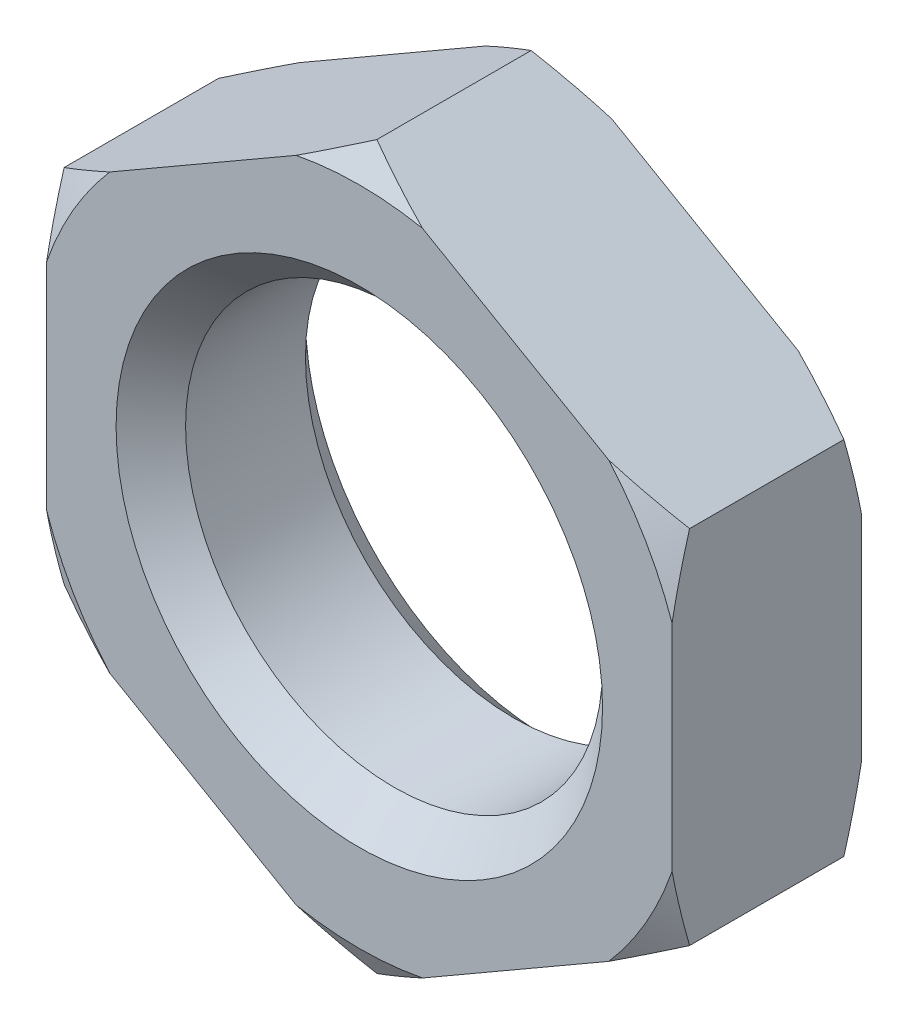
ISO-10303-21;
HEADER;
FILE_DESCRIPTION(('STEP AP214'),'2;1');
FILE_NAME('part.step','',(''),(''),'','','');
FILE_SCHEMA(('AUTOMOTIVE_DESIGN { 1 0 10303 214 1 1 1 1 }'));
ENDSEC;
DATA;
#1=APPLICATION_CONTEXT('core data for automotive mechanical design processes');
#2=APPLICATION_PROTOCOL_DEFINITION('international standard','automotive_design',2000,#1);
#3=PRODUCT_CONTEXT('',#1,'mechanical');
#4=PRODUCT('Part','Part','',(#3));
#5=PRODUCT_RELATED_PRODUCT_CATEGORY('part','',(#4));
#6=PRODUCT_DEFINITION_FORMATION('','',#4);
#7=PRODUCT_DEFINITION_CONTEXT('part definition',#1,'design');
#8=PRODUCT_DEFINITION('design','',#6,#7);
#9=PRODUCT_DEFINITION_SHAPE('','',#8);
#10=(LENGTH_UNIT() NAMED_UNIT(*) SI_UNIT(.MILLI.,.METRE.));
#11=(NAMED_UNIT(*) PLANE_ANGLE_UNIT() SI_UNIT($,.RADIAN.));
#12=(NAMED_UNIT(*) SI_UNIT($,.STERADIAN.) SOLID_ANGLE_UNIT());
#13=UNCERTAINTY_MEASURE_WITH_UNIT(LENGTH_MEASURE(1.E-05),#10,'distance_accuracy_value','');
#14=(GEOMETRIC_REPRESENTATION_CONTEXT(3) GLOBAL_UNCERTAINTY_ASSIGNED_CONTEXT((#13)) GLOBAL_UNIT_ASSIGNED_CONTEXT((#10,
#11,#12)) REPRESENTATION_CONTEXT('',''));
#15=CARTESIAN_POINT('',(0.,0.,0.));
#16=DIRECTION('',(0.,0.,1.));
#17=DIRECTION('',(1.,0.,0.));
#18=AXIS2_PLACEMENT_3D('',#15,#16,#17);
#19=CARTESIAN_POINT('',(0.,0.,-5.45));
#20=DIRECTION('',(0.,0.,1.));
#21=DIRECTION('',(1.,0.,0.));
#22=AXIS2_PLACEMENT_3D('',#19,#20,#21);
#23=PLANE('',#22);
#24=CARTESIAN_POINT('',(0.,0.,-5.45));
#25=DIRECTION('',(0.,0.,1.));
#26=DIRECTION('',(1.,0.,0.));
#27=AXIS2_PLACEMENT_3D('',#24,#25,#26);
#28=CIRCLE('',#27,14.);
#29=CARTESIAN_POINT('',(14.,0.,-5.45));
#30=VERTEX_POINT('',#29);
#31=EDGE_CURVE('E425',#30,#30,#28,.T.);
#32=ORIENTED_EDGE('',*,*,#31,.T.);
#33=EDGE_LOOP('',(#32));
#34=FACE_BOUND('',#33,.T.);
#35=DIRECTION('',(0.,1.,0.));
#36=VECTOR('',#35,1.);
#37=CARTESIAN_POINT('',(18.,-10.3923048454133,-5.45));
#38=LINE('',#37,#36);
#39=CARTESIAN_POINT('',(18.,-6.1900214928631,-5.45));
#40=VERTEX_POINT('',#39);
#41=CARTESIAN_POINT('',(18.,6.19002149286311,-5.45));
#42=VERTEX_POINT('',#41);
#43=EDGE_CURVE('E362',#40,#42,#38,.T.);
#44=ORIENTED_EDGE('',*,*,#43,.F.);
#45=CARTESIAN_POINT('',(0.,0.,-5.45));
#46=DIRECTION('',(0.,0.,-1.));
#47=DIRECTION('',(-1.,0.,0.));
#48=AXIS2_PLACEMENT_3D('',#45,#46,#47);
#49=CIRCLE('',#48,19.0346096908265);
#50=CARTESIAN_POINT('',(14.3607158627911,-12.4934465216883,-5.45));
#51=VERTEX_POINT('',#50);
#52=EDGE_CURVE('E350',#40,#51,#49,.T.);
#53=ORIENTED_EDGE('',*,*,#52,.T.);
#54=DIRECTION('',(0.866025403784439,0.5,0.));
#55=VECTOR('',#54,1.);
#56=CARTESIAN_POINT('',(0.,-20.7846096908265,-5.45));
#57=LINE('',#56,#55);
#58=CARTESIAN_POINT('',(3.63928413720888,-18.6834680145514,-5.45));
#59=VERTEX_POINT('',#58);
#60=EDGE_CURVE('E372',#59,#51,#57,.T.);
#61=ORIENTED_EDGE('',*,*,#60,.F.);
#62=CARTESIAN_POINT('',(-3.63928413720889,-18.6834680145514,-5.45));
#63=VERTEX_POINT('',#62);
#64=EDGE_CURVE('E346',#59,#63,#49,.T.);
#65=ORIENTED_EDGE('',*,*,#64,.T.);
#66=DIRECTION('',(0.866025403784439,-0.5,0.));
#67=VECTOR('',#66,1.);
#68=CARTESIAN_POINT('',(-18.,-10.3923048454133,-5.45));
#69=LINE('',#68,#67);
#70=CARTESIAN_POINT('',(-14.3607158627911,-12.4934465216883,-5.45));
#71=VERTEX_POINT('',#70);
#72=EDGE_CURVE('E379',#71,#63,#69,.T.);
#73=ORIENTED_EDGE('',*,*,#72,.F.);
#74=CARTESIAN_POINT('',(-18.,-6.19002149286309,-5.45));
#75=VERTEX_POINT('',#74);
#76=EDGE_CURVE('E339',#71,#75,#49,.T.);
#77=ORIENTED_EDGE('',*,*,#76,.T.);
#78=DIRECTION('',(0.,-1.,0.));
#79=VECTOR('',#78,1.);
#80=CARTESIAN_POINT('',(-18.,10.3923048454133,-5.45));
#81=LINE('',#80,#79);
#82=CARTESIAN_POINT('',(-18.,6.19002149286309,-5.45));
#83=VERTEX_POINT('',#82);
#84=EDGE_CURVE('E476',#83,#75,#81,.T.);
#85=ORIENTED_EDGE('',*,*,#84,.F.);
#86=CARTESIAN_POINT('',(-14.3607158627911,12.4934465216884,-5.45));
#87=VERTEX_POINT('',#86);
#88=EDGE_CURVE('E63',#83,#87,#49,.T.);
#89=ORIENTED_EDGE('',*,*,#88,.T.);
#90=DIRECTION('',(-0.866025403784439,-0.5,0.));
#91=VECTOR('',#90,1.);
#92=CARTESIAN_POINT('',(0.,20.7846096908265,-5.45));
#93=LINE('',#92,#91);
#94=CARTESIAN_POINT('',(-3.63928413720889,18.6834680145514,-5.45));
#95=VERTEX_POINT('',#94);
#96=EDGE_CURVE('E181',#95,#87,#93,.T.);
#97=ORIENTED_EDGE('',*,*,#96,.F.);
#98=CARTESIAN_POINT('',(3.63928413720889,18.6834680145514,-5.45));
#99=VERTEX_POINT('',#98);
#100=EDGE_CURVE('E55',#95,#99,#49,.T.);
#101=ORIENTED_EDGE('',*,*,#100,.T.);
#102=DIRECTION('',(-0.866025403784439,0.5,0.));
#103=VECTOR('',#102,1.);
#104=CARTESIAN_POINT('',(18.,10.3923048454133,-5.45));
#105=LINE('',#104,#103);
#106=CARTESIAN_POINT('',(14.3607158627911,12.4934465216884,-5.45));
#107=VERTEX_POINT('',#106);
#108=EDGE_CURVE('E363',#107,#99,#105,.T.);
#109=ORIENTED_EDGE('',*,*,#108,.F.);
#110=EDGE_CURVE('E344',#107,#42,#49,.T.);
#111=ORIENTED_EDGE('',*,*,#110,.T.);
#112=EDGE_LOOP('',(#44,#53,#61,#65,#73,#77,#85,#89,#97,#101,#109,#111));
#113=FACE_BOUND('',#112,.T.);
#114=ADVANCED_FACE('F39',(#34,#113),#23,.F.);
#115=CARTESIAN_POINT('',(0.,0.,5.45));
#116=DIRECTION('',(0.,0.,1.));
#117=DIRECTION('',(1.,0.,0.));
#118=AXIS2_PLACEMENT_3D('',#115,#116,#117);
#119=PLANE('',#118);
#120=CARTESIAN_POINT('',(0.,0.,5.45));
#121=DIRECTION('',(0.,0.,1.));
#122=DIRECTION('',(1.,0.,0.));
#123=AXIS2_PLACEMENT_3D('',#120,#121,#122);
#124=CIRCLE('',#123,14.);
#125=CARTESIAN_POINT('',(14.,0.,5.45));
#126=VERTEX_POINT('',#125);
#127=EDGE_CURVE('E11',#126,#126,#124,.F.);
#128=ORIENTED_EDGE('',*,*,#127,.T.);
#129=EDGE_LOOP('',(#128));
#130=FACE_BOUND('',#129,.T.);
#131=CARTESIAN_POINT('',(0.,0.,5.45));
#132=DIRECTION('',(0.,0.,-1.));
#133=DIRECTION('',(-1.,0.,0.));
#134=AXIS2_PLACEMENT_3D('',#131,#132,#133);
#135=CIRCLE('',#134,19.0346096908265);
#136=CARTESIAN_POINT('',(18.,-6.1900214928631,5.45));
#137=VERTEX_POINT('',#136);
#138=CARTESIAN_POINT('',(14.3607158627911,-12.4934465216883,5.45));
#139=VERTEX_POINT('',#138);
#140=EDGE_CURVE('E315',#137,#139,#135,.T.);
#141=ORIENTED_EDGE('',*,*,#140,.F.);
#142=DIRECTION('',(0.,1.,0.));
#143=VECTOR('',#142,1.);
#144=CARTESIAN_POINT('',(18.,-10.3923048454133,5.45));
#145=LINE('',#144,#143);
#146=CARTESIAN_POINT('',(18.,6.19002149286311,5.45));
#147=VERTEX_POINT('',#146);
#148=EDGE_CURVE('E386',#137,#147,#145,.T.);
#149=ORIENTED_EDGE('',*,*,#148,.T.);
#150=CARTESIAN_POINT('',(14.3607158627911,12.4934465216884,5.45));
#151=VERTEX_POINT('',#150);
#152=EDGE_CURVE('E306',#151,#147,#135,.T.);
#153=ORIENTED_EDGE('',*,*,#152,.F.);
#154=DIRECTION('',(-0.866025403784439,0.5,0.));
#155=VECTOR('',#154,1.);
#156=CARTESIAN_POINT('',(18.,10.3923048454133,5.45));
#157=LINE('',#156,#155);
#158=CARTESIAN_POINT('',(3.63928413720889,18.6834680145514,5.45));
#159=VERTEX_POINT('',#158);
#160=EDGE_CURVE('E371',#151,#159,#157,.T.);
#161=ORIENTED_EDGE('',*,*,#160,.T.);
#162=CARTESIAN_POINT('',(-3.63928413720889,18.6834680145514,5.45));
#163=VERTEX_POINT('',#162);
#164=EDGE_CURVE('E297',#163,#159,#135,.T.);
#165=ORIENTED_EDGE('',*,*,#164,.F.);
#166=DIRECTION('',(-0.866025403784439,-0.5,0.));
#167=VECTOR('',#166,1.);
#168=CARTESIAN_POINT('',(0.,20.7846096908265,5.45));
#169=LINE('',#168,#167);
#170=CARTESIAN_POINT('',(-14.3607158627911,12.4934465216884,5.45));
#171=VERTEX_POINT('',#170);
#172=EDGE_CURVE('E377',#163,#171,#169,.T.);
#173=ORIENTED_EDGE('',*,*,#172,.T.);
#174=CARTESIAN_POINT('',(-18.,6.19002149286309,5.45));
#175=VERTEX_POINT('',#174);
#176=EDGE_CURVE('E295',#175,#171,#135,.T.);
#177=ORIENTED_EDGE('',*,*,#176,.F.);
#178=DIRECTION('',(0.,-1.,0.));
#179=VECTOR('',#178,1.);
#180=CARTESIAN_POINT('',(-18.,10.3923048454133,5.45));
#181=LINE('',#180,#179);
#182=CARTESIAN_POINT('',(-18.,-6.19002149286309,5.45));
#183=VERTEX_POINT('',#182);
#184=EDGE_CURVE('E483',#175,#183,#181,.T.);
#185=ORIENTED_EDGE('',*,*,#184,.T.);
#186=CARTESIAN_POINT('',(-14.3607158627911,-12.4934465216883,5.45));
#187=VERTEX_POINT('',#186);
#188=EDGE_CURVE('E298',#187,#183,#135,.T.);
#189=ORIENTED_EDGE('',*,*,#188,.F.);
#190=DIRECTION('',(0.866025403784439,-0.5,0.));
#191=VECTOR('',#190,1.);
#192=CARTESIAN_POINT('',(-18.,-10.3923048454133,5.45));
#193=LINE('',#192,#191);
#194=CARTESIAN_POINT('',(-3.63928413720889,-18.6834680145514,5.45));
#195=VERTEX_POINT('',#194);
#196=EDGE_CURVE('E468',#187,#195,#193,.T.);
#197=ORIENTED_EDGE('',*,*,#196,.T.);
#198=CARTESIAN_POINT('',(3.63928413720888,-18.6834680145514,5.45));
#199=VERTEX_POINT('',#198);
#200=EDGE_CURVE('E308',#199,#195,#135,.T.);
#201=ORIENTED_EDGE('',*,*,#200,.F.);
#202=DIRECTION('',(0.866025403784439,0.5,0.));
#203=VECTOR('',#202,1.);
#204=CARTESIAN_POINT('',(0.,-20.7846096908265,5.45));
#205=LINE('',#204,#203);
#206=EDGE_CURVE('E463',#199,#139,#205,.T.);
#207=ORIENTED_EDGE('',*,*,#206,.T.);
#208=EDGE_LOOP('',(#141,#149,#153,#161,#165,#173,#177,#185,#189,#197,#201,#207));
#209=FACE_BOUND('',#208,.T.);
#210=ADVANCED_FACE('F416',(#130,#209),#119,.T.);
#211=CARTESIAN_POINT('',(18.,10.3923048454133,5.45));
#212=DIRECTION('',(-0.5,-0.866025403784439,0.));
#213=DIRECTION('',(0.866025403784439,-0.5,0.));
#214=AXIS2_PLACEMENT_3D('',#211,#212,#213);
#215=PLANE('',#214);
#216=DIRECTION('',(0.,0.,-1.));
#217=VECTOR('',#216,1.);
#218=CARTESIAN_POINT('',(18.,10.3923048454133,5.45));
#219=LINE('',#218,#217);
#220=CARTESIAN_POINT('',(18.,10.3923048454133,4.43963702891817));
#221=VERTEX_POINT('',#220);
#222=CARTESIAN_POINT('',(18.,10.3923048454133,-4.43963702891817));
#223=VERTEX_POINT('',#222);
#224=EDGE_CURVE('E383',#221,#223,#219,.T.);
#225=ORIENTED_EDGE('',*,*,#224,.T.);
#226=CARTESIAN_POINT('',(30.4856915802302,3.1836874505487,1.25700348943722));
#227=CARTESIAN_POINT('',(30.2029644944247,3.3469200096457,1.10444503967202));
#228=CARTESIAN_POINT('',(29.9198944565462,3.51035057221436,0.952734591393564));
#229=CARTESIAN_POINT('',(29.3530083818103,3.83764240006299,0.651175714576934));
#230=CARTESIAN_POINT('',(29.0691923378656,4.00150366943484,0.501327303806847));
#231=CARTESIAN_POINT('',(28.2164767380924,4.49381925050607,0.0547937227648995));
#232=CARTESIAN_POINT('',(27.646375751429,4.82296720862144,-0.238844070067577));
#233=CARTESIAN_POINT('',(26.5006239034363,5.48446734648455,-0.817268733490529));
#234=CARTESIAN_POINT('',(25.9249610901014,5.81682642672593,-1.10202410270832));
#235=CARTESIAN_POINT('',(24.7693191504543,6.48403661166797,-1.65958470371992));
#236=CARTESIAN_POINT('',(24.1893401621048,6.81888763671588,-1.93239031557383));
#237=CARTESIAN_POINT('',(23.0096086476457,7.50000594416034,-2.47016036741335));
#238=CARTESIAN_POINT('',(22.4097276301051,7.84634741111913,-2.73475058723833));
#239=CARTESIAN_POINT('',(21.2039055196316,8.54252913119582,-3.24505463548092));
#240=CARTESIAN_POINT('',(20.5979641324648,8.8923695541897,-3.49076754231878));
#241=CARTESIAN_POINT('',(19.3799107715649,9.5956129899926,-3.95862920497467));
#242=CARTESIAN_POINT('',(18.7678053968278,9.94901219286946,-4.1808007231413));
#243=CARTESIAN_POINT('',(17.5363249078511,10.660007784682,-4.59645694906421));
#244=CARTESIAN_POINT('',(16.9169507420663,11.0176036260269,-4.78994535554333));
#245=CARTESIAN_POINT('',(15.8648096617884,11.6250575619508,-5.08720834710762));
#246=CARTESIAN_POINT('',(15.4339869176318,11.8737931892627,-5.20015833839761));
#247=CARTESIAN_POINT('',(14.5689626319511,12.3732151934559,-5.40735185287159));
#248=CARTESIAN_POINT('',(14.1347611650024,12.6239015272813,-5.50159578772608));
#249=CARTESIAN_POINT('',(13.2634461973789,13.1269554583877,-5.66924364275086));
#250=CARTESIAN_POINT('',(12.8263334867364,13.3793225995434,-5.74265299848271));
#251=CARTESIAN_POINT('',(11.9496796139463,13.8854589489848,-5.86677434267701));
#252=CARTESIAN_POINT('',(11.5101384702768,14.1392281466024,-5.91748650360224));
#253=CARTESIAN_POINT('',(10.6345563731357,14.6447457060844,-5.99431572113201));
#254=CARTESIAN_POINT('',(10.1985338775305,14.8964834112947,-6.02071096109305));
#255=CARTESIAN_POINT('',(9.32589505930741,15.4003016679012,-6.04912203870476));
#256=CARTESIAN_POINT('',(8.8892787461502,15.6523822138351,-6.05113826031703));
#257=CARTESIAN_POINT('',(8.01645329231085,16.1563082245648,-6.03072760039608));
#258=CARTESIAN_POINT('',(7.58024417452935,16.4081536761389,-6.00829941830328));
#259=CARTESIAN_POINT('',(6.70923299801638,16.9110322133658,-5.93967983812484));
#260=CARTESIAN_POINT('',(6.2744310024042,17.1620652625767,-5.89348738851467));
#261=CARTESIAN_POINT('',(5.24677871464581,17.7553805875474,-5.75739690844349));
#262=CARTESIAN_POINT('',(4.65489854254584,18.0971027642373,-5.65765601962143));
#263=CARTESIAN_POINT('',(3.47680150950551,18.7772774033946,-5.42066654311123));
#264=CARTESIAN_POINT('',(2.89058560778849,19.1157293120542,-5.28341171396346));
#265=CARTESIAN_POINT('',(1.72396810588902,19.7892762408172,-4.97659649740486));
#266=CARTESIAN_POINT('',(1.1435730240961,20.1243674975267,-4.80700340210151));
#267=CARTESIAN_POINT('',(-0.0107173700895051,20.7907973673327,-4.44083623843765));
#268=CARTESIAN_POINT('',(-0.584612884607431,21.1221360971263,-4.24426301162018));
#269=CARTESIAN_POINT('',(-1.73289242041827,21.7850955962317,-3.82640151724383));
#270=CARTESIAN_POINT('',(-2.3072049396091,22.1166750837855,-3.6048530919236));
#271=CARTESIAN_POINT('',(-3.45012921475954,22.7765427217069,-3.14303561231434));
#272=CARTESIAN_POINT('',(-4.01874092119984,23.1048308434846,-2.90276639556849));
#273=CARTESIAN_POINT('',(-5.15060384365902,23.7583122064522,-2.40701329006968));
#274=CARTESIAN_POINT('',(-5.71385771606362,24.0835069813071,-2.15153745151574));
#275=CARTESIAN_POINT('',(-6.8359294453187,24.7313353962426,-1.62798864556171));
#276=CARTESIAN_POINT('',(-7.39474739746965,25.0539690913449,-1.35991594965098));
#277=CARTESIAN_POINT('',(-8.33466067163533,25.5966282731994,-0.898675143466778));
#278=CARTESIAN_POINT('',(-8.71677063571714,25.817239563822,-0.708252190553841));
#279=CARTESIAN_POINT('',(-9.47933095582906,26.257503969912,-0.323065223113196));
#280=CARTESIAN_POINT('',(-9.85978136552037,26.4771571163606,-0.128301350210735));
#281=CARTESIAN_POINT('',(-10.6152211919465,26.9133105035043,0.263002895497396));
#282=CARTESIAN_POINT('',(-10.9902261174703,27.1298196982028,0.459503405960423));
#283=CARTESIAN_POINT('',(-11.7389165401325,27.5620763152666,0.855848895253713));
#284=CARTESIAN_POINT('',(-12.1126020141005,27.7778237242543,1.05569393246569));
#285=CARTESIAN_POINT('',(-12.4856915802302,27.9932270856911,1.25700348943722));
#286=B_SPLINE_CURVE_WITH_KNOTS('',3,(#226,#227,#228,#229,#230,#231,#232,#233,#234,#235,#236,
#237,#238,#239,#240,#241,#242,#243,#244,#245,#246,#247,#248,#249,#250,#251,#252,#253,#254,#255,
#256,#257,#258,#259,#260,#261,#262,#263,#264,#265,#266,#267,#268,#269,#270,#271,#272,#273,#274,
#275,#276,#277,#278,#279,#280,#281,#282,#283,#284,#285),.UNSPECIFIED.,.F.,.F.,(4,2,2,2,2,2,2,2,
2,2,2,2,2,2,2,2,2,2,2,2,2,2,2,2,2,2,2,2,2,4),(0.,1.08105368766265,2.16211768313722,
4.32449828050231,6.49383305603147,8.66309878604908,10.8873689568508,13.1117476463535,
15.3339555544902,17.5558766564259,19.0859698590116,20.6160293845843,22.1456893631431,
23.6753377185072,25.1872614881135,26.6991614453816,28.2111418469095,29.7231891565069,
31.7939874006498,33.8651303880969,35.9383794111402,38.0115637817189,40.1087882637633,
42.2060309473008,44.3021730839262,46.3982700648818,47.8399285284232,49.2815400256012,
50.7080794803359,52.1346438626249),.UNSPECIFIED.);
#287=EDGE_CURVE('E319',#223,#107,#286,.T.);
#288=ORIENTED_EDGE('',*,*,#287,.T.);
#289=ORIENTED_EDGE('',*,*,#108,.T.);
#290=CARTESIAN_POINT('',(0.,20.7846096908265,-4.43963702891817));
#291=VERTEX_POINT('',#290);
#292=EDGE_CURVE('E309',#99,#291,#286,.T.);
#293=ORIENTED_EDGE('',*,*,#292,.T.);
#294=DIRECTION('',(0.,0.,-1.));
#295=VECTOR('',#294,1.);
#296=CARTESIAN_POINT('',(0.,20.7846096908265,5.45));
#297=LINE('',#296,#295);
#298=CARTESIAN_POINT('',(0.,20.7846096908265,4.43963702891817));
#299=VERTEX_POINT('',#298);
#300=EDGE_CURVE('E190',#299,#291,#297,.T.);
#301=ORIENTED_EDGE('',*,*,#300,.F.);
#302=CARTESIAN_POINT('',(-12.4856915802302,27.9932270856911,-1.25700348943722));
#303=CARTESIAN_POINT('',(-12.2029644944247,27.8299945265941,-1.10444503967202));
#304=CARTESIAN_POINT('',(-11.9198944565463,27.6665639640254,-0.952734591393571));
#305=CARTESIAN_POINT('',(-11.3530083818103,27.3392721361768,-0.65117571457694));
#306=CARTESIAN_POINT('',(-11.0691923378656,27.175410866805,-0.501327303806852));
#307=CARTESIAN_POINT('',(-10.2164767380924,26.6830952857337,-0.0547937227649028));
#308=CARTESIAN_POINT('',(-9.64637575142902,26.3539473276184,0.238844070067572));
#309=CARTESIAN_POINT('',(-8.50062390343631,25.6924471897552,0.817268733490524));
#310=CARTESIAN_POINT('',(-7.92496109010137,25.3600881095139,1.10202410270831));
#311=CARTESIAN_POINT('',(-6.76931915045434,24.6928779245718,1.65958470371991));
#312=CARTESIAN_POINT('',(-6.18934016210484,24.3580268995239,1.93239031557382));
#313=CARTESIAN_POINT('',(-5.00960864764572,23.6769085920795,2.47016036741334));
#314=CARTESIAN_POINT('',(-4.40972763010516,23.3305671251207,2.73475058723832));
#315=CARTESIAN_POINT('',(-3.20390551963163,22.634385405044,3.24505463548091));
#316=CARTESIAN_POINT('',(-2.59796413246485,22.2845449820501,3.49076754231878));
#317=CARTESIAN_POINT('',(-1.37991077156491,21.5813015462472,3.95862920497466));
#318=CARTESIAN_POINT('',(-0.767805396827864,21.2279023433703,4.1808007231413));
#319=CARTESIAN_POINT('',(0.463675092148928,20.5169067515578,4.5964569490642));
#320=CARTESIAN_POINT('',(1.08304925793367,20.1593109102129,4.78994535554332));
#321=CARTESIAN_POINT('',(2.13519033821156,19.551856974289,5.08720834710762));
#322=CARTESIAN_POINT('',(2.56601308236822,19.3031213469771,5.20015833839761));
#323=CARTESIAN_POINT('',(3.43103736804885,18.8036993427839,5.40735185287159));
#324=CARTESIAN_POINT('',(3.86523883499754,18.5530130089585,5.50159578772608));
#325=CARTESIAN_POINT('',(4.73655380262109,18.0499590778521,5.66924364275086));
#326=CARTESIAN_POINT('',(5.17366651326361,17.7975919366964,5.74265299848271));
#327=CARTESIAN_POINT('',(6.05032038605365,17.291455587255,5.86677434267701));
#328=CARTESIAN_POINT('',(6.48986152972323,17.0376863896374,5.91748650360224));
#329=CARTESIAN_POINT('',(7.36544362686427,16.5321688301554,5.99431572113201));
#330=CARTESIAN_POINT('',(7.80146612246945,16.280431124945,6.02071096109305));
#331=CARTESIAN_POINT('',(8.67410494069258,15.7766128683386,6.04912203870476));
#332=CARTESIAN_POINT('',(9.11072125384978,15.5245323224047,6.05113826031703));
#333=CARTESIAN_POINT('',(9.98354670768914,15.020606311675,6.03072760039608));
#334=CARTESIAN_POINT('',(10.4197558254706,14.7687608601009,6.00829941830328));
#335=CARTESIAN_POINT('',(11.2907670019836,14.2658823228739,5.93967983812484));
#336=CARTESIAN_POINT('',(11.7255689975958,14.0148492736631,5.89348738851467));
#337=CARTESIAN_POINT('',(12.7532212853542,13.4215339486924,5.75739690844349));
#338=CARTESIAN_POINT('',(13.3451014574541,13.0798117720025,5.65765601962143));
#339=CARTESIAN_POINT('',(14.5231984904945,12.3996371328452,5.42066654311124));
#340=CARTESIAN_POINT('',(15.1094143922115,12.0611852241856,5.28341171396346));
#341=CARTESIAN_POINT('',(16.276031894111,11.3876382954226,4.97659649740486));
#342=CARTESIAN_POINT('',(16.8564269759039,11.0525470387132,4.80700340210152));
#343=CARTESIAN_POINT('',(18.0107173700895,10.3861171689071,4.44083623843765));
#344=CARTESIAN_POINT('',(18.5846128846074,10.0547784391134,4.24426301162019));
#345=CARTESIAN_POINT('',(19.7328924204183,9.39181894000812,3.82640151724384));
#346=CARTESIAN_POINT('',(20.3072049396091,9.06023945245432,3.60485309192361));
#347=CARTESIAN_POINT('',(21.4501292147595,8.40037181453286,3.14303561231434));
#348=CARTESIAN_POINT('',(22.0187409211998,8.07208369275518,2.9027663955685));
#349=CARTESIAN_POINT('',(23.150603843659,7.41860232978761,2.40701329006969));
#350=CARTESIAN_POINT('',(23.7138577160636,7.09340755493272,2.15153745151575));
#351=CARTESIAN_POINT('',(24.8359294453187,6.44557913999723,1.62798864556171));
#352=CARTESIAN_POINT('',(25.3947473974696,6.12294544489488,1.35991594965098));
#353=CARTESIAN_POINT('',(26.3346606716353,5.58028626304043,0.898675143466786));
#354=CARTESIAN_POINT('',(26.7167706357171,5.35967497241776,0.708252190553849));
#355=CARTESIAN_POINT('',(27.4793309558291,4.91941056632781,0.323065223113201));
#356=CARTESIAN_POINT('',(27.8597813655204,4.69975741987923,0.12830135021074));
#357=CARTESIAN_POINT('',(28.6152211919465,4.26360403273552,-0.263002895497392));
#358=CARTESIAN_POINT('',(28.9902261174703,4.04709483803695,-0.45950340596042));
#359=CARTESIAN_POINT('',(29.7389165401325,3.61483822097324,-0.855848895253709));
#360=CARTESIAN_POINT('',(30.1126020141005,3.39909081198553,-1.05569393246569));
#361=CARTESIAN_POINT('',(30.4856915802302,3.1836874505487,-1.25700348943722));
#362=B_SPLINE_CURVE_WITH_KNOTS('',3,(#302,#303,#304,#305,#306,#307,#308,#309,#310,#311,#312,
#313,#314,#315,#316,#317,#318,#319,#320,#321,#322,#323,#324,#325,#326,#327,#328,#329,#330,#331,
#332,#333,#334,#335,#336,#337,#338,#339,#340,#341,#342,#343,#344,#345,#346,#347,#348,#349,#350,
#351,#352,#353,#354,#355,#356,#357,#358,#359,#360,#361),.UNSPECIFIED.,.F.,.F.,(4,2,2,2,2,2,2,2,
2,2,2,2,2,2,2,2,2,2,2,2,2,2,2,2,2,2,2,2,2,4),(0.,1.08105368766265,2.16211768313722,
4.32449828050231,6.49383305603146,8.66309878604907,10.8873689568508,13.1117476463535,
15.3339555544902,17.5558766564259,19.0859698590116,20.6160293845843,22.1456893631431,
23.6753377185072,25.1872614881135,26.6991614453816,28.2111418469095,29.7231891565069,
31.7939874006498,33.8651303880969,35.9383794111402,38.0115637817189,40.1087882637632,
42.2060309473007,44.3021730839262,46.3982700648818,47.8399285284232,49.2815400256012,
50.7080794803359,52.1346438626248),.UNSPECIFIED.);
#363=EDGE_CURVE('E473',#299,#159,#362,.T.);
#364=ORIENTED_EDGE('',*,*,#363,.T.);
#365=ORIENTED_EDGE('',*,*,#160,.F.);
#366=EDGE_CURVE('E248',#151,#221,#362,.T.);
#367=ORIENTED_EDGE('',*,*,#366,.T.);
#368=EDGE_LOOP('',(#225,#288,#289,#293,#301,#364,#365,#367));
#369=FACE_BOUND('',#368,.T.);
#370=ADVANCED_FACE('F421',(#369),#215,.F.);
#371=CARTESIAN_POINT('',(0.,20.7846096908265,5.45));
#372=DIRECTION('',(0.5,-0.866025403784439,0.));
#373=DIRECTION('',(0.866025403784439,0.5,0.));
#374=AXIS2_PLACEMENT_3D('',#371,#372,#373);
#375=PLANE('',#374);
#376=ORIENTED_EDGE('',*,*,#300,.T.);
#377=CARTESIAN_POINT('',(12.4856915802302,27.9932270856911,1.25700348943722));
#378=CARTESIAN_POINT('',(12.2029644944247,27.8299945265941,1.10444503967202));
#379=CARTESIAN_POINT('',(11.9198944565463,27.6665639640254,0.952734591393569));
#380=CARTESIAN_POINT('',(11.3530083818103,27.3392721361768,0.651175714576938));
#381=CARTESIAN_POINT('',(11.0691923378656,27.175410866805,0.501327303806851));
#382=CARTESIAN_POINT('',(10.2164767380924,26.6830952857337,0.0547937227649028));
#383=CARTESIAN_POINT('',(9.64637575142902,26.3539473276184,-0.238844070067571));
#384=CARTESIAN_POINT('',(8.50062390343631,25.6924471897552,-0.817268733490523));
#385=CARTESIAN_POINT('',(7.92496109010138,25.3600881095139,-1.10202410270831));
#386=CARTESIAN_POINT('',(6.76931915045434,24.6928779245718,-1.65958470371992));
#387=CARTESIAN_POINT('',(6.18934016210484,24.3580268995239,-1.93239031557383));
#388=CARTESIAN_POINT('',(5.00960864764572,23.6769085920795,-2.47016036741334));
#389=CARTESIAN_POINT('',(4.40972763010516,23.3305671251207,-2.73475058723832));
#390=CARTESIAN_POINT('',(3.20390551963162,22.634385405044,-3.24505463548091));
#391=CARTESIAN_POINT('',(2.59796413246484,22.2845449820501,-3.49076754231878));
#392=CARTESIAN_POINT('',(1.37991077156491,21.5813015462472,-3.95862920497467));
#393=CARTESIAN_POINT('',(0.767805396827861,21.2279023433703,-4.1808007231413));
#394=CARTESIAN_POINT('',(-0.46367509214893,20.5169067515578,-4.59645694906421));
#395=CARTESIAN_POINT('',(-1.08304925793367,20.1593109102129,-4.78994535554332));
#396=CARTESIAN_POINT('',(-2.13519033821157,19.551856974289,-5.08720834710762));
#397=CARTESIAN_POINT('',(-2.56601308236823,19.3031213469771,-5.20015833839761));
#398=CARTESIAN_POINT('',(-3.43103736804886,18.8036993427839,-5.40735185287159));
#399=CARTESIAN_POINT('',(-3.86523883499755,18.5530130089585,-5.50159578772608));
#400=CARTESIAN_POINT('',(-4.7365538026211,18.0499590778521,-5.66924364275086));
#401=CARTESIAN_POINT('',(-5.17366651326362,17.7975919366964,-5.74265299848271));
#402=CARTESIAN_POINT('',(-6.05032038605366,17.291455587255,-5.86677434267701));
#403=CARTESIAN_POINT('',(-6.48986152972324,17.0376863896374,-5.91748650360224));
#404=CARTESIAN_POINT('',(-7.36544362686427,16.5321688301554,-5.99431572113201));
#405=CARTESIAN_POINT('',(-7.80146612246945,16.280431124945,-6.02071096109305));
#406=CARTESIAN_POINT('',(-8.67410494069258,15.7766128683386,-6.04912203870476));
#407=CARTESIAN_POINT('',(-9.11072125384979,15.5245323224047,-6.05113826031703));
#408=CARTESIAN_POINT('',(-9.98354670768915,15.020606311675,-6.03072760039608));
#409=CARTESIAN_POINT('',(-10.4197558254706,14.7687608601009,-6.00829941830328));
#410=CARTESIAN_POINT('',(-11.2907670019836,14.2658823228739,-5.93967983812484));
#411=CARTESIAN_POINT('',(-11.7255689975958,14.0148492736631,-5.89348738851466));
#412=CARTESIAN_POINT('',(-12.7532212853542,13.4215339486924,-5.75739690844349));
#413=CARTESIAN_POINT('',(-13.3451014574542,13.0798117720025,-5.65765601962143));
#414=CARTESIAN_POINT('',(-14.5231984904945,12.3996371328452,-5.42066654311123));
#415=CARTESIAN_POINT('',(-15.1094143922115,12.0611852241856,-5.28341171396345));
#416=CARTESIAN_POINT('',(-16.276031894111,11.3876382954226,-4.97659649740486));
#417=CARTESIAN_POINT('',(-16.8564269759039,11.0525470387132,-4.80700340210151));
#418=CARTESIAN_POINT('',(-18.0107173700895,10.3861171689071,-4.44083623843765));
#419=CARTESIAN_POINT('',(-18.5846128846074,10.0547784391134,-4.24426301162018));
#420=CARTESIAN_POINT('',(-19.7328924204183,9.39181894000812,-3.82640151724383));
#421=CARTESIAN_POINT('',(-20.3072049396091,9.06023945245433,-3.6048530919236));
#422=CARTESIAN_POINT('',(-21.4501292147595,8.40037181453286,-3.14303561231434));
#423=CARTESIAN_POINT('',(-22.0187409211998,8.07208369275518,-2.90276639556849));
#424=CARTESIAN_POINT('',(-23.150603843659,7.41860232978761,-2.40701329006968));
#425=CARTESIAN_POINT('',(-23.7138577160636,7.09340755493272,-2.15153745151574));
#426=CARTESIAN_POINT('',(-24.8359294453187,6.44557913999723,-1.6279886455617));
#427=CARTESIAN_POINT('',(-25.3947473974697,6.12294544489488,-1.35991594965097));
#428=CARTESIAN_POINT('',(-26.3346606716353,5.58028626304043,-0.898675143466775));
#429=CARTESIAN_POINT('',(-26.7167706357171,5.35967497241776,-0.708252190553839));
#430=CARTESIAN_POINT('',(-27.4793309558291,4.91941056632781,-0.323065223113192));
#431=CARTESIAN_POINT('',(-27.8597813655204,4.69975741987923,-0.12830135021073));
#432=CARTESIAN_POINT('',(-28.6152211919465,4.26360403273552,0.263002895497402));
#433=CARTESIAN_POINT('',(-28.9902261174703,4.04709483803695,0.45950340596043));
#434=CARTESIAN_POINT('',(-29.7389165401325,3.61483822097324,0.855848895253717));
#435=CARTESIAN_POINT('',(-30.1126020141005,3.39909081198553,1.05569393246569));
#436=CARTESIAN_POINT('',(-30.4856915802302,3.18368745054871,1.25700348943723));
#437=B_SPLINE_CURVE_WITH_KNOTS('',3,(#377,#378,#379,#380,#381,#382,#383,#384,#385,#386,#387,
#388,#389,#390,#391,#392,#393,#394,#395,#396,#397,#398,#399,#400,#401,#402,#403,#404,#405,#406,
#407,#408,#409,#410,#411,#412,#413,#414,#415,#416,#417,#418,#419,#420,#421,#422,#423,#424,#425,
#426,#427,#428,#429,#430,#431,#432,#433,#434,#435,#436),.UNSPECIFIED.,.F.,.F.,(4,2,2,2,2,2,2,2,
2,2,2,2,2,2,2,2,2,2,2,2,2,2,2,2,2,2,2,2,2,4),(0.,1.08105368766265,2.16211768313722,
4.3244982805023,6.49383305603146,8.66309878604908,10.8873689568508,13.1117476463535,
15.3339555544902,17.5558766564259,19.0859698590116,20.6160293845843,22.1456893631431,
23.6753377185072,25.1872614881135,26.6991614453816,28.2111418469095,29.7231891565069,
31.7939874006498,33.8651303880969,35.9383794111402,38.0115637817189,40.1087882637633,
42.2060309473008,44.3021730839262,46.3982700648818,47.8399285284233,49.2815400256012,
50.7080794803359,52.1346438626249),.UNSPECIFIED.);
#438=EDGE_CURVE('E183',#291,#95,#437,.T.);
#439=ORIENTED_EDGE('',*,*,#438,.T.);
#440=ORIENTED_EDGE('',*,*,#96,.T.);
#441=CARTESIAN_POINT('',(-18.,10.3923048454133,-4.43963702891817));
#442=VERTEX_POINT('',#441);
#443=EDGE_CURVE('E165',#87,#442,#437,.T.);
#444=ORIENTED_EDGE('',*,*,#443,.T.);
#445=DIRECTION('',(0.,0.,-1.));
#446=VECTOR('',#445,1.);
#447=CARTESIAN_POINT('',(-18.,10.3923048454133,5.45));
#448=LINE('',#447,#446);
#449=CARTESIAN_POINT('',(-18.,10.3923048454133,4.43963702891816));
#450=VERTEX_POINT('',#449);
#451=EDGE_CURVE('E179',#450,#442,#448,.T.);
#452=ORIENTED_EDGE('',*,*,#451,.F.);
#453=CARTESIAN_POINT('',(-30.4856915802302,3.18368745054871,-1.25700348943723));
#454=CARTESIAN_POINT('',(-30.2029644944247,3.3469200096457,-1.10444503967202));
#455=CARTESIAN_POINT('',(-29.9198944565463,3.51035057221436,-0.95273459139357));
#456=CARTESIAN_POINT('',(-29.3530083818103,3.83764240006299,-0.65117571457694));
#457=CARTESIAN_POINT('',(-29.0691923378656,4.00150366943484,-0.501327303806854));
#458=CARTESIAN_POINT('',(-28.2164767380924,4.49381925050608,-0.0547937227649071));
#459=CARTESIAN_POINT('',(-27.646375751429,4.82296720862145,0.23884407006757));
#460=CARTESIAN_POINT('',(-26.5006239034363,5.48446734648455,0.817268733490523));
#461=CARTESIAN_POINT('',(-25.9249610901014,5.81682642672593,1.10202410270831));
#462=CARTESIAN_POINT('',(-24.7693191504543,6.48403661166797,1.65958470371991));
#463=CARTESIAN_POINT('',(-24.1893401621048,6.81888763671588,1.93239031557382));
#464=CARTESIAN_POINT('',(-23.0096086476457,7.50000594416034,2.47016036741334));
#465=CARTESIAN_POINT('',(-22.4097276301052,7.84634741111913,2.73475058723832));
#466=CARTESIAN_POINT('',(-21.2039055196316,8.54252913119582,3.24505463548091));
#467=CARTESIAN_POINT('',(-20.5979641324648,8.8923695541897,3.49076754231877));
#468=CARTESIAN_POINT('',(-19.3799107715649,9.5956129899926,3.95862920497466));
#469=CARTESIAN_POINT('',(-18.7678053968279,9.94901219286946,4.1808007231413));
#470=CARTESIAN_POINT('',(-17.5363249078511,10.660007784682,4.5964569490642));
#471=CARTESIAN_POINT('',(-16.9169507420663,11.0176036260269,4.78994535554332));
#472=CARTESIAN_POINT('',(-15.8648096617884,11.6250575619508,5.08720834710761));
#473=CARTESIAN_POINT('',(-15.4339869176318,11.8737931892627,5.20015833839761));
#474=CARTESIAN_POINT('',(-14.5689626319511,12.3732151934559,5.40735185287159));
#475=CARTESIAN_POINT('',(-14.1347611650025,12.6239015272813,5.50159578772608));
#476=CARTESIAN_POINT('',(-13.2634461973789,13.1269554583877,5.66924364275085));
#477=CARTESIAN_POINT('',(-12.8263334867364,13.3793225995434,5.74265299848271));
#478=CARTESIAN_POINT('',(-11.9496796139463,13.8854589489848,5.866774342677));
#479=CARTESIAN_POINT('',(-11.5101384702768,14.1392281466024,5.91748650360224));
#480=CARTESIAN_POINT('',(-10.6345563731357,14.6447457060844,5.99431572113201));
#481=CARTESIAN_POINT('',(-10.1985338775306,14.8964834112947,6.02071096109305));
#482=CARTESIAN_POINT('',(-9.32589505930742,15.4003016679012,6.04912203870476));
#483=CARTESIAN_POINT('',(-8.88927874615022,15.6523822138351,6.05113826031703));
#484=CARTESIAN_POINT('',(-8.01645329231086,16.1563082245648,6.03072760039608));
#485=CARTESIAN_POINT('',(-7.58024417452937,16.4081536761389,6.00829941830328));
#486=CARTESIAN_POINT('',(-6.70923299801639,16.9110322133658,5.93967983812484));
#487=CARTESIAN_POINT('',(-6.27443100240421,17.1620652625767,5.89348738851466));
#488=CARTESIAN_POINT('',(-5.24677871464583,17.7553805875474,5.75739690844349));
#489=CARTESIAN_POINT('',(-4.65489854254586,18.0971027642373,5.65765601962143));
#490=CARTESIAN_POINT('',(-3.47680150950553,18.7772774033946,5.42066654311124));
#491=CARTESIAN_POINT('',(-2.89058560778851,19.1157293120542,5.28341171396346));
#492=CARTESIAN_POINT('',(-1.72396810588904,19.7892762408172,4.97659649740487));
#493=CARTESIAN_POINT('',(-1.14357302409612,20.1243674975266,4.80700340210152));
#494=CARTESIAN_POINT('',(0.0107173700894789,20.7907973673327,4.44083623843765));
#495=CARTESIAN_POINT('',(0.584612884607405,21.1221360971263,4.24426301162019));
#496=CARTESIAN_POINT('',(1.73289242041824,21.7850955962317,3.82640151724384));
#497=CARTESIAN_POINT('',(2.30720493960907,22.1166750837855,3.60485309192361));
#498=CARTESIAN_POINT('',(3.45012921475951,22.7765427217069,3.14303561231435));
#499=CARTESIAN_POINT('',(4.01874092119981,23.1048308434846,2.90276639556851));
#500=CARTESIAN_POINT('',(5.15060384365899,23.7583122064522,2.40701329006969));
#501=CARTESIAN_POINT('',(5.71385771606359,24.0835069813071,2.15153745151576));
#502=CARTESIAN_POINT('',(6.83592944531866,24.7313353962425,1.62798864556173));
#503=CARTESIAN_POINT('',(7.39474739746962,25.0539690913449,1.35991594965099));
#504=CARTESIAN_POINT('',(8.3346606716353,25.5966282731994,0.898675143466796));
#505=CARTESIAN_POINT('',(8.71677063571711,25.817239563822,0.708252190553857));
#506=CARTESIAN_POINT('',(9.47933095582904,26.257503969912,0.323065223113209));
#507=CARTESIAN_POINT('',(9.85978136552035,26.4771571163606,0.128301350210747));
#508=CARTESIAN_POINT('',(10.6152211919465,26.9133105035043,-0.263002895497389));
#509=CARTESIAN_POINT('',(10.9902261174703,27.1298196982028,-0.45950340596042));
#510=CARTESIAN_POINT('',(11.7389165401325,27.5620763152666,-0.855848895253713));
#511=CARTESIAN_POINT('',(12.1126020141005,27.7778237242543,-1.05569393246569));
#512=CARTESIAN_POINT('',(12.4856915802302,27.9932270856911,-1.25700348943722));
#513=B_SPLINE_CURVE_WITH_KNOTS('',3,(#453,#454,#455,#456,#457,#458,#459,#460,#461,#462,#463,
#464,#465,#466,#467,#468,#469,#470,#471,#472,#473,#474,#475,#476,#477,#478,#479,#480,#481,#482,
#483,#484,#485,#486,#487,#488,#489,#490,#491,#492,#493,#494,#495,#496,#497,#498,#499,#500,#501,
#502,#503,#504,#505,#506,#507,#508,#509,#510,#511,#512),.UNSPECIFIED.,.F.,.F.,(4,2,2,2,2,2,2,2,
2,2,2,2,2,2,2,2,2,2,2,2,2,2,2,2,2,2,2,2,2,4),(0.,1.08105368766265,2.16211768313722,
4.32449828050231,6.49383305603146,8.66309878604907,10.8873689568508,13.1117476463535,
15.3339555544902,17.5558766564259,19.0859698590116,20.6160293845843,22.1456893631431,
23.6753377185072,25.1872614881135,26.6991614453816,28.2111418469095,29.7231891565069,
31.7939874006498,33.8651303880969,35.9383794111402,38.0115637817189,40.1087882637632,
42.2060309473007,44.3021730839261,46.3982700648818,47.8399285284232,49.2815400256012,
50.7080794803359,52.1346438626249),.UNSPECIFIED.);
#514=EDGE_CURVE('E268',#450,#171,#513,.T.);
#515=ORIENTED_EDGE('',*,*,#514,.T.);
#516=ORIENTED_EDGE('',*,*,#172,.F.);
#517=EDGE_CURVE('E480',#163,#299,#513,.T.);
#518=ORIENTED_EDGE('',*,*,#517,.T.);
#519=EDGE_LOOP('',(#376,#439,#440,#444,#452,#515,#516,#518));
#520=FACE_BOUND('',#519,.T.);
#521=ADVANCED_FACE('F177',(#520),#375,.F.);
#522=CARTESIAN_POINT('',(-18.,10.3923048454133,5.45));
#523=DIRECTION('',(1.,0.,0.));
#524=DIRECTION('',(0.,0.,-1.));
#525=AXIS2_PLACEMENT_3D('',#522,#523,#524);
#526=PLANE('',#525);
#527=ORIENTED_EDGE('',*,*,#451,.T.);
#528=CARTESIAN_POINT('',(-18.,22.8779964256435,0.367134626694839));
#529=CARTESIAN_POINT('',(-18.,22.552887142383,0.219620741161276));
#530=CARTESIAN_POINT('',(-18.,22.2273282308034,0.0730985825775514));
#531=CARTESIAN_POINT('',(-18.,21.5752312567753,-0.2177619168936));
#532=CARTESIAN_POINT('',(-18.,21.2486931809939,-0.362100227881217));
#533=CARTESIAN_POINT('',(-18.,20.2673936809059,-0.791580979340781));
#534=CARTESIAN_POINT('',(-18.,19.6110563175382,-1.07313947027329));
#535=CARTESIAN_POINT('',(-18.,18.2907734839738,-1.62585019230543));
#536=CARTESIAN_POINT('',(-18.,17.6268076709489,-1.89695395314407));
#537=CARTESIAN_POINT('',(-18.,16.293259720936,-2.42494527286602));
#538=CARTESIAN_POINT('',(-18.,15.6236778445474,-2.68183348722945));
#539=CARTESIAN_POINT('',(-18.,14.2811093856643,-3.17710073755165));
#540=CARTESIAN_POINT('',(-18.,13.6081518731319,-3.41555818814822));
#541=CARTESIAN_POINT('',(-18.,12.255041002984,-3.87136840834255));
#542=CARTESIAN_POINT('',(-18.,11.5748872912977,-4.08872013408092));
#543=CARTESIAN_POINT('',(-18.,10.20771011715,-4.49733436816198));
#544=CARTESIAN_POINT('',(-18.,9.52069693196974,-4.68863100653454));
#545=CARTESIAN_POINT('',(-18.,8.13872297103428,-5.04001230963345));
#546=CARTESIAN_POINT('',(-18.,7.44376331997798,-5.20010133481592));
#547=CARTESIAN_POINT('',(-18.,6.24391484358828,-5.44317875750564));
#548=CARTESIAN_POINT('',(-18.,5.74084874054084,-5.53516830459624));
#549=CARTESIAN_POINT('',(-18.,4.73128321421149,-5.69797024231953));
#550=CARTESIAN_POINT('',(-18.,4.22478389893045,-5.76878329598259));
#551=CARTESIAN_POINT('',(-18.,3.2092021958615,-5.88735755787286));
#552=CARTESIAN_POINT('',(-18.,2.70012049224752,-5.93512457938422));
#553=CARTESIAN_POINT('',(-18.,1.6802392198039,-6.00624484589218));
#554=CARTESIAN_POINT('',(-18.,1.16943965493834,-6.0295981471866));
#555=CARTESIAN_POINT('',(-18.,0.147561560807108,-6.05116240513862));
#556=CARTESIAN_POINT('',(-18.,-0.363516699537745,-6.04938598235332));
#557=CARTESIAN_POINT('',(-18.,-1.38496157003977,-6.02077808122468));
#558=CARTESIAN_POINT('',(-18.,-1.89532818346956,-5.99394671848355));
#559=CARTESIAN_POINT('',(-18.,-2.9142484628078,-5.91604800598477));
#560=CARTESIAN_POINT('',(-18.,-3.42280193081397,-5.86497808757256));
#561=CARTESIAN_POINT('',(-18.,-4.43709088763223,-5.74007122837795));
#562=CARTESIAN_POINT('',(-18.,-4.94282625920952,-5.66623334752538));
#563=CARTESIAN_POINT('',(-18.,-6.20139601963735,-5.45577130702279));
#564=CARTESIAN_POINT('',(-18.,-6.95207231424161,-5.30618286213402));
#565=CARTESIAN_POINT('',(-18.,-8.44443224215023,-4.9673961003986));
#566=CARTESIAN_POINT('',(-18.,-9.18611385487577,-4.77818905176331));
#567=CARTESIAN_POINT('',(-18.,-10.6619474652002,-4.36682330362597));
#568=CARTESIAN_POINT('',(-18.,-11.396079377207,-4.14459323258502));
#569=CARTESIAN_POINT('',(-18.,-12.8557048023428,-3.67376147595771));
#570=CARTESIAN_POINT('',(-18.,-13.5811989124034,-3.42516162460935));
#571=CARTESIAN_POINT('',(-18.,-15.0327114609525,-2.903809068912));
#572=CARTESIAN_POINT('',(-18.,-15.7586424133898,-2.63081428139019));
#573=CARTESIAN_POINT('',(-18.,-17.2037247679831,-2.06739254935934));
#574=CARTESIAN_POINT('',(-18.,-17.9228757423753,-1.77696451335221));
#575=CARTESIAN_POINT('',(-18.,-19.3509004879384,-1.18389612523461));
#576=CARTESIAN_POINT('',(-18.,-20.0598103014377,-0.881342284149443));
#577=CARTESIAN_POINT('',(-18.,-21.1193796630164,-0.419078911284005));
#578=CARTESIAN_POINT('',(-18.,-21.471896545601,-0.263604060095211));
#579=CARTESIAN_POINT('',(-18.,-22.1757821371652,0.0499074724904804));
#580=CARTESIAN_POINT('',(-18.,-22.5271508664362,0.207944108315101));
#581=CARTESIAN_POINT('',(-18.,-22.8779964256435,0.367134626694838));
#582=B_SPLINE_CURVE_WITH_KNOTS('',3,(#528,#529,#530,#531,#532,#533,#534,#535,#536,#537,#538,
#539,#540,#541,#542,#543,#544,#545,#546,#547,#548,#549,#550,#551,#552,#553,#554,#555,#556,#557,
#558,#559,#560,#561,#562,#563,#564,#565,#566,#567,#568,#569,#570,#571,#572,#573,#574,#575,#576,
#577,#578,#579,#580,#581),.UNSPECIFIED.,.F.,.F.,(4,2,2,2,2,2,2,2,2,2,2,2,2,2,2,2,2,2,2,2,2,2,2,
2,2,2,4),(0.,1.0710279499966,2.14207055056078,4.28451610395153,6.43592590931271,
8.58723643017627,10.7288228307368,12.8705150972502,15.0093743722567,17.1479345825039,
18.6817650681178,20.2155475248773,21.7489428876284,23.2823347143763,24.8149564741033,
26.3475711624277,27.8803483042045,29.4131887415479,31.7081213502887,34.0035602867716,
36.3040344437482,38.6043486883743,40.9307682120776,43.2573335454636,45.5695285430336,
46.7253600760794,47.8811710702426),.UNSPECIFIED.);
#583=EDGE_CURVE('E162',#442,#83,#582,.T.);
#584=ORIENTED_EDGE('',*,*,#583,.T.);
#585=ORIENTED_EDGE('',*,*,#84,.T.);
#586=CARTESIAN_POINT('',(-18.,-10.3923048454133,-4.43963702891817));
#587=VERTEX_POINT('',#586);
#588=EDGE_CURVE('E171',#75,#587,#582,.T.);
#589=ORIENTED_EDGE('',*,*,#588,.T.);
#590=DIRECTION('',(0.,0.,-1.));
#591=VECTOR('',#590,1.);
#592=CARTESIAN_POINT('',(-18.,-10.3923048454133,5.45));
#593=LINE('',#592,#591);
#594=CARTESIAN_POINT('',(-18.,-10.3923048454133,4.43963702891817));
#595=VERTEX_POINT('',#594);
#596=EDGE_CURVE('E191',#595,#587,#593,.T.);
#597=ORIENTED_EDGE('',*,*,#596,.F.);
#598=CARTESIAN_POINT('',(-18.,-22.8779964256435,-0.367134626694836));
#599=CARTESIAN_POINT('',(-18.,-22.552887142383,-0.219620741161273));
#600=CARTESIAN_POINT('',(-18.,-22.2273282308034,-0.0730985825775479));
#601=CARTESIAN_POINT('',(-18.,-21.5752312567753,0.217761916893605));
#602=CARTESIAN_POINT('',(-18.,-21.2486931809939,0.362100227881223));
#603=CARTESIAN_POINT('',(-18.,-20.2673936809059,0.791580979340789));
#604=CARTESIAN_POINT('',(-18.,-19.6110563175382,1.0731394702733));
#605=CARTESIAN_POINT('',(-18.,-18.2907734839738,1.62585019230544));
#606=CARTESIAN_POINT('',(-18.,-17.6268076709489,1.89695395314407));
#607=CARTESIAN_POINT('',(-18.,-16.293259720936,2.42494527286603));
#608=CARTESIAN_POINT('',(-18.,-15.6236778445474,2.68183348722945));
#609=CARTESIAN_POINT('',(-18.,-14.2811093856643,3.17710073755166));
#610=CARTESIAN_POINT('',(-18.,-13.6081518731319,3.41555818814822));
#611=CARTESIAN_POINT('',(-18.,-12.255041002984,3.87136840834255));
#612=CARTESIAN_POINT('',(-18.,-11.5748872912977,4.08872013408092));
#613=CARTESIAN_POINT('',(-18.,-10.2077101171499,4.49733436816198));
#614=CARTESIAN_POINT('',(-18.,-9.52069693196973,4.68863100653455));
#615=CARTESIAN_POINT('',(-18.,-8.13872297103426,5.04001230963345));
#616=CARTESIAN_POINT('',(-18.,-7.44376331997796,5.20010133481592));
#617=CARTESIAN_POINT('',(-18.,-6.24391484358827,5.44317875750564));
#618=CARTESIAN_POINT('',(-18.,-5.74084874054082,5.53516830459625));
#619=CARTESIAN_POINT('',(-18.,-4.73128321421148,5.69797024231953));
#620=CARTESIAN_POINT('',(-18.,-4.22478389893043,5.76878329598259));
#621=CARTESIAN_POINT('',(-18.,-3.20920219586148,5.88735755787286));
#622=CARTESIAN_POINT('',(-18.,-2.70012049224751,5.93512457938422));
#623=CARTESIAN_POINT('',(-18.,-1.68023921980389,6.00624484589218));
#624=CARTESIAN_POINT('',(-18.,-1.16943965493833,6.0295981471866));
#625=CARTESIAN_POINT('',(-18.,-0.147561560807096,6.05116240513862));
#626=CARTESIAN_POINT('',(-18.,0.363516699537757,6.04938598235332));
#627=CARTESIAN_POINT('',(-18.,1.38496157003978,6.02077808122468));
#628=CARTESIAN_POINT('',(-18.,1.89532818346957,5.99394671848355));
#629=CARTESIAN_POINT('',(-18.,2.91424846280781,5.91604800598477));
#630=CARTESIAN_POINT('',(-18.,3.42280193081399,5.86497808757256));
#631=CARTESIAN_POINT('',(-18.,4.43709088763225,5.74007122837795));
#632=CARTESIAN_POINT('',(-18.,4.94282625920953,5.66623334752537));
#633=CARTESIAN_POINT('',(-18.,6.20139601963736,5.45577130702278));
#634=CARTESIAN_POINT('',(-18.,6.95207231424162,5.30618286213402));
#635=CARTESIAN_POINT('',(-18.,8.44443224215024,4.96739610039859));
#636=CARTESIAN_POINT('',(-18.,9.18611385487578,4.77818905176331));
#637=CARTESIAN_POINT('',(-18.,10.6619474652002,4.36682330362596));
#638=CARTESIAN_POINT('',(-18.,11.396079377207,4.14459323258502));
#639=CARTESIAN_POINT('',(-18.,12.8557048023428,3.6737614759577));
#640=CARTESIAN_POINT('',(-18.,13.5811989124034,3.42516162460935));
#641=CARTESIAN_POINT('',(-18.,15.0327114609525,2.90380906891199));
#642=CARTESIAN_POINT('',(-18.,15.7586424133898,2.63081428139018));
#643=CARTESIAN_POINT('',(-18.,17.2037247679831,2.06739254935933));
#644=CARTESIAN_POINT('',(-18.,17.9228757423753,1.77696451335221));
#645=CARTESIAN_POINT('',(-18.,19.3509004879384,1.18389612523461));
#646=CARTESIAN_POINT('',(-18.,20.0598103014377,0.881342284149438));
#647=CARTESIAN_POINT('',(-18.,21.1193796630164,0.419078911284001));
#648=CARTESIAN_POINT('',(-18.,21.471896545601,0.263604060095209));
#649=CARTESIAN_POINT('',(-18.,22.1757821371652,-0.0499074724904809));
#650=CARTESIAN_POINT('',(-18.,22.5271508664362,-0.207944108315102));
#651=CARTESIAN_POINT('',(-18.,22.8779964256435,-0.367134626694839));
#652=B_SPLINE_CURVE_WITH_KNOTS('',3,(#598,#599,#600,#601,#602,#603,#604,#605,#606,#607,#608,
#609,#610,#611,#612,#613,#614,#615,#616,#617,#618,#619,#620,#621,#622,#623,#624,#625,#626,#627,
#628,#629,#630,#631,#632,#633,#634,#635,#636,#637,#638,#639,#640,#641,#642,#643,#644,#645,#646,
#647,#648,#649,#650,#651),.UNSPECIFIED.,.F.,.F.,(4,2,2,2,2,2,2,2,2,2,2,2,2,2,2,2,2,2,2,2,2,2,2,
2,2,2,4),(0.,1.0710279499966,2.14207055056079,4.28451610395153,6.43592590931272,
8.58723643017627,10.7288228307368,12.8705150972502,15.0093743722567,17.1479345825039,
18.6817650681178,20.2155475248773,21.7489428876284,23.2823347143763,24.8149564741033,
26.3475711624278,27.8803483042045,29.4131887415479,31.7081213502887,34.0035602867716,
36.3040344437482,38.6043486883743,40.9307682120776,43.2573335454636,45.5695285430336,
46.7253600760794,47.8811710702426),.UNSPECIFIED.);
#653=EDGE_CURVE('E260',#595,#183,#652,.T.);
#654=ORIENTED_EDGE('',*,*,#653,.T.);
#655=ORIENTED_EDGE('',*,*,#184,.F.);
#656=EDGE_CURVE('E188',#175,#450,#652,.T.);
#657=ORIENTED_EDGE('',*,*,#656,.T.);
#658=EDGE_LOOP('',(#527,#584,#585,#589,#597,#654,#655,#657));
#659=FACE_BOUND('',#658,.T.);
#660=ADVANCED_FACE('F186',(#659),#526,.F.);
#661=CARTESIAN_POINT('',(-18.,-10.3923048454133,5.45));
#662=DIRECTION('',(0.5,0.866025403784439,0.));
#663=DIRECTION('',(-0.866025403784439,0.5,0.));
#664=AXIS2_PLACEMENT_3D('',#661,#662,#663);
#665=PLANE('',#664);
#666=ORIENTED_EDGE('',*,*,#596,.T.);
#667=CARTESIAN_POINT('',(-30.4856915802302,-3.18368745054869,1.25700348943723));
#668=CARTESIAN_POINT('',(-30.2029644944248,-3.34692000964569,1.10444503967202));
#669=CARTESIAN_POINT('',(-29.9198944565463,-3.51035057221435,0.952734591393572));
#670=CARTESIAN_POINT('',(-29.3530083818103,-3.83764240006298,0.651175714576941));
#671=CARTESIAN_POINT('',(-29.0691923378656,-4.00150366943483,0.501327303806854));
#672=CARTESIAN_POINT('',(-28.2164767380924,-4.49381925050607,0.0547937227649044));
#673=CARTESIAN_POINT('',(-27.646375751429,-4.82296720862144,-0.238844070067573));
#674=CARTESIAN_POINT('',(-26.5006239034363,-5.48446734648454,-0.817268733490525));
#675=CARTESIAN_POINT('',(-25.9249610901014,-5.81682642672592,-1.10202410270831));
#676=CARTESIAN_POINT('',(-24.7693191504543,-6.48403661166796,-1.65958470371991));
#677=CARTESIAN_POINT('',(-24.1893401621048,-6.81888763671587,-1.93239031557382));
#678=CARTESIAN_POINT('',(-23.0096086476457,-7.50000594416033,-2.47016036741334));
#679=CARTESIAN_POINT('',(-22.4097276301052,-7.84634741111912,-2.73475058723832));
#680=CARTESIAN_POINT('',(-21.2039055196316,-8.54252913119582,-3.24505463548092));
#681=CARTESIAN_POINT('',(-20.5979641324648,-8.8923695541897,-3.49076754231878));
#682=CARTESIAN_POINT('',(-19.3799107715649,-9.5956129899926,-3.95862920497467));
#683=CARTESIAN_POINT('',(-18.7678053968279,-9.94901219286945,-4.1808007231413));
#684=CARTESIAN_POINT('',(-17.5363249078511,-10.660007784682,-4.59645694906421));
#685=CARTESIAN_POINT('',(-16.9169507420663,-11.0176036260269,-4.78994535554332));
#686=CARTESIAN_POINT('',(-15.8648096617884,-11.6250575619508,-5.08720834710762));
#687=CARTESIAN_POINT('',(-15.4339869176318,-11.8737931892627,-5.20015833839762));
#688=CARTESIAN_POINT('',(-14.5689626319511,-12.3732151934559,-5.40735185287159));
#689=CARTESIAN_POINT('',(-14.1347611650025,-12.6239015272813,-5.50159578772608));
#690=CARTESIAN_POINT('',(-13.2634461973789,-13.1269554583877,-5.66924364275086));
#691=CARTESIAN_POINT('',(-12.8263334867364,-13.3793225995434,-5.74265299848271));
#692=CARTESIAN_POINT('',(-11.9496796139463,-13.8854589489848,-5.86677434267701));
#693=CARTESIAN_POINT('',(-11.5101384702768,-14.1392281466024,-5.91748650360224));
#694=CARTESIAN_POINT('',(-10.6345563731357,-14.6447457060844,-5.99431572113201));
#695=CARTESIAN_POINT('',(-10.1985338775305,-14.8964834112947,-6.02071096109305));
#696=CARTESIAN_POINT('',(-9.32589505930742,-15.4003016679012,-6.04912203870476));
#697=CARTESIAN_POINT('',(-8.88927874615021,-15.6523822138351,-6.05113826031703));
#698=CARTESIAN_POINT('',(-8.01645329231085,-16.1563082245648,-6.03072760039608));
#699=CARTESIAN_POINT('',(-7.58024417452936,-16.4081536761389,-6.00829941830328));
#700=CARTESIAN_POINT('',(-6.70923299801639,-16.9110322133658,-5.93967983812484));
#701=CARTESIAN_POINT('',(-6.2744310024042,-17.1620652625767,-5.89348738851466));
#702=CARTESIAN_POINT('',(-5.24677871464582,-17.7553805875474,-5.75739690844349));
#703=CARTESIAN_POINT('',(-4.65489854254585,-18.0971027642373,-5.65765601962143));
#704=CARTESIAN_POINT('',(-3.47680150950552,-18.7772774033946,-5.42066654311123));
#705=CARTESIAN_POINT('',(-2.89058560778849,-19.1157293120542,-5.28341171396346));
#706=CARTESIAN_POINT('',(-1.72396810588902,-19.7892762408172,-4.97659649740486));
#707=CARTESIAN_POINT('',(-1.1435730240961,-20.1243674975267,-4.80700340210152));
#708=CARTESIAN_POINT('',(0.0107173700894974,-20.7907973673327,-4.44083623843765));
#709=CARTESIAN_POINT('',(0.584612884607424,-21.1221360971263,-4.24426301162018));
#710=CARTESIAN_POINT('',(1.73289242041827,-21.7850955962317,-3.82640151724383));
#711=CARTESIAN_POINT('',(2.3072049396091,-22.1166750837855,-3.6048530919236));
#712=CARTESIAN_POINT('',(3.45012921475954,-22.7765427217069,-3.14303561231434));
#713=CARTESIAN_POINT('',(4.01874092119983,-23.1048308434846,-2.90276639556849));
#714=CARTESIAN_POINT('',(5.15060384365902,-23.7583122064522,-2.40701329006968));
#715=CARTESIAN_POINT('',(5.71385771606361,-24.0835069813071,-2.15153745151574));
#716=CARTESIAN_POINT('',(6.83592944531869,-24.7313353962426,-1.62798864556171));
#717=CARTESIAN_POINT('',(7.39474739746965,-25.0539690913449,-1.35991594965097));
#718=CARTESIAN_POINT('',(8.33466067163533,-25.5966282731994,-0.898675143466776));
#719=CARTESIAN_POINT('',(8.71677063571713,-25.817239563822,-0.70825219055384));
#720=CARTESIAN_POINT('',(9.47933095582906,-26.257503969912,-0.323065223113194));
#721=CARTESIAN_POINT('',(9.85978136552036,-26.4771571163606,-0.128301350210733));
#722=CARTESIAN_POINT('',(10.6152211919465,-26.9133105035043,0.263002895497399));
#723=CARTESIAN_POINT('',(10.9902261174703,-27.1298196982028,0.459503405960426));
#724=CARTESIAN_POINT('',(11.7389165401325,-27.5620763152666,0.855848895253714));
#725=CARTESIAN_POINT('',(12.1126020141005,-27.7778237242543,1.05569393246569));
#726=CARTESIAN_POINT('',(12.4856915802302,-27.9932270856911,1.25700348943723));
#727=B_SPLINE_CURVE_WITH_KNOTS('',3,(#667,#668,#669,#670,#671,#672,#673,#674,#675,#676,#677,
#678,#679,#680,#681,#682,#683,#684,#685,#686,#687,#688,#689,#690,#691,#692,#693,#694,#695,#696,
#697,#698,#699,#700,#701,#702,#703,#704,#705,#706,#707,#708,#709,#710,#711,#712,#713,#714,#715,
#716,#717,#718,#719,#720,#721,#722,#723,#724,#725,#726),.UNSPECIFIED.,.F.,.F.,(4,2,2,2,2,2,2,2,
2,2,2,2,2,2,2,2,2,2,2,2,2,2,2,2,2,2,2,2,2,4),(0.,1.08105368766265,2.16211768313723,
4.32449828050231,6.49383305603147,8.66309878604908,10.8873689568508,13.1117476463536,
15.3339555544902,17.5558766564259,19.0859698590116,20.6160293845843,22.1456893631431,
23.6753377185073,25.1872614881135,26.6991614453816,28.2111418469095,29.7231891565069,
31.7939874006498,33.8651303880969,35.9383794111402,38.0115637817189,40.1087882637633,
42.2060309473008,44.3021730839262,46.3982700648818,47.8399285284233,49.2815400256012,
50.7080794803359,52.1346438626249),.UNSPECIFIED.);
#728=EDGE_CURVE('E286',#587,#71,#727,.T.);
#729=ORIENTED_EDGE('',*,*,#728,.T.);
#730=ORIENTED_EDGE('',*,*,#72,.T.);
#731=CARTESIAN_POINT('',(0.,-20.7846096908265,-4.43963702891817));
#732=VERTEX_POINT('',#731);
#733=EDGE_CURVE('E287',#63,#732,#727,.T.);
#734=ORIENTED_EDGE('',*,*,#733,.T.);
#735=DIRECTION('',(0.,0.,-1.));
#736=VECTOR('',#735,1.);
#737=CARTESIAN_POINT('',(0.,-20.7846096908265,5.45));
#738=LINE('',#737,#736);
#739=CARTESIAN_POINT('',(0.,-20.7846096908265,4.43963702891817));
#740=VERTEX_POINT('',#739);
#741=EDGE_CURVE('E200',#740,#732,#738,.T.);
#742=ORIENTED_EDGE('',*,*,#741,.F.);
#743=CARTESIAN_POINT('',(12.4856915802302,-27.9932270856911,-1.25700348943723));
#744=CARTESIAN_POINT('',(12.2029644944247,-27.8299945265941,-1.10444503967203));
#745=CARTESIAN_POINT('',(11.9198944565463,-27.6665639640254,-0.952734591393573));
#746=CARTESIAN_POINT('',(11.3530083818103,-27.3392721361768,-0.651175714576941));
#747=CARTESIAN_POINT('',(11.0691923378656,-27.175410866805,-0.501327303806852));
#748=CARTESIAN_POINT('',(10.2164767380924,-26.6830952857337,-0.0547937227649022));
#749=CARTESIAN_POINT('',(9.64637575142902,-26.3539473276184,0.238844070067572));
#750=CARTESIAN_POINT('',(8.5006239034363,-25.6924471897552,0.817268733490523));
#751=CARTESIAN_POINT('',(7.92496109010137,-25.3600881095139,1.10202410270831));
#752=CARTESIAN_POINT('',(6.76931915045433,-24.6928779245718,1.65958470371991));
#753=CARTESIAN_POINT('',(6.18934016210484,-24.3580268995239,1.93239031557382));
#754=CARTESIAN_POINT('',(5.00960864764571,-23.6769085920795,2.47016036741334));
#755=CARTESIAN_POINT('',(4.40972763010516,-23.3305671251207,2.73475058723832));
#756=CARTESIAN_POINT('',(3.20390551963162,-22.634385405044,3.24505463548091));
#757=CARTESIAN_POINT('',(2.59796413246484,-22.2845449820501,3.49076754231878));
#758=CARTESIAN_POINT('',(1.3799107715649,-21.5813015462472,3.95862920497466));
#759=CARTESIAN_POINT('',(0.767805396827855,-21.2279023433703,4.1808007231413));
#760=CARTESIAN_POINT('',(-0.463675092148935,-20.5169067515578,4.59645694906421));
#761=CARTESIAN_POINT('',(-1.08304925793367,-20.1593109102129,4.78994535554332));
#762=CARTESIAN_POINT('',(-2.13519033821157,-19.551856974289,5.08720834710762));
#763=CARTESIAN_POINT('',(-2.56601308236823,-19.3031213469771,5.20015833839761));
#764=CARTESIAN_POINT('',(-3.43103736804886,-18.8036993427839,5.40735185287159));
#765=CARTESIAN_POINT('',(-3.86523883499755,-18.5530130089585,5.50159578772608));
#766=CARTESIAN_POINT('',(-4.7365538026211,-18.0499590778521,5.66924364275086));
#767=CARTESIAN_POINT('',(-5.17366651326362,-17.7975919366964,5.74265299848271));
#768=CARTESIAN_POINT('',(-6.05032038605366,-17.291455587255,5.866774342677));
#769=CARTESIAN_POINT('',(-6.48986152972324,-17.0376863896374,5.91748650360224));
#770=CARTESIAN_POINT('',(-7.36544362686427,-16.5321688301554,5.99431572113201));
#771=CARTESIAN_POINT('',(-7.80146612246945,-16.280431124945,6.02071096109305));
#772=CARTESIAN_POINT('',(-8.67410494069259,-15.7766128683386,6.04912203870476));
#773=CARTESIAN_POINT('',(-9.11072125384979,-15.5245323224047,6.05113826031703));
#774=CARTESIAN_POINT('',(-9.98354670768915,-15.020606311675,6.03072760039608));
#775=CARTESIAN_POINT('',(-10.4197558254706,-14.7687608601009,6.00829941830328));
#776=CARTESIAN_POINT('',(-11.2907670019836,-14.2658823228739,5.93967983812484));
#777=CARTESIAN_POINT('',(-11.7255689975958,-14.0148492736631,5.89348738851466));
#778=CARTESIAN_POINT('',(-12.7532212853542,-13.4215339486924,5.75739690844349));
#779=CARTESIAN_POINT('',(-13.3451014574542,-13.0798117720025,5.65765601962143));
#780=CARTESIAN_POINT('',(-14.5231984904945,-12.3996371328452,5.42066654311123));
#781=CARTESIAN_POINT('',(-15.1094143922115,-12.0611852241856,5.28341171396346));
#782=CARTESIAN_POINT('',(-16.276031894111,-11.3876382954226,4.97659649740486));
#783=CARTESIAN_POINT('',(-16.8564269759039,-11.0525470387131,4.80700340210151));
#784=CARTESIAN_POINT('',(-18.0107173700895,-10.3861171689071,4.44083623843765));
#785=CARTESIAN_POINT('',(-18.5846128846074,-10.0547784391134,4.24426301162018));
#786=CARTESIAN_POINT('',(-19.7328924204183,-9.39181894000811,3.82640151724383));
#787=CARTESIAN_POINT('',(-20.3072049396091,-9.06023945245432,3.6048530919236));
#788=CARTESIAN_POINT('',(-21.4501292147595,-8.40037181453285,3.14303561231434));
#789=CARTESIAN_POINT('',(-22.0187409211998,-8.07208369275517,2.90276639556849));
#790=CARTESIAN_POINT('',(-23.150603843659,-7.41860232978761,2.40701329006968));
#791=CARTESIAN_POINT('',(-23.7138577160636,-7.09340755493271,2.15153745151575));
#792=CARTESIAN_POINT('',(-24.8359294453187,-6.44557913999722,1.62798864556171));
#793=CARTESIAN_POINT('',(-25.3947473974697,-6.12294544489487,1.35991594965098));
#794=CARTESIAN_POINT('',(-26.3346606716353,-5.58028626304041,0.898675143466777));
#795=CARTESIAN_POINT('',(-26.7167706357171,-5.35967497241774,0.70825219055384));
#796=CARTESIAN_POINT('',(-27.4793309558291,-4.9194105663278,0.323065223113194));
#797=CARTESIAN_POINT('',(-27.8597813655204,-4.69975741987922,0.128301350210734));
#798=CARTESIAN_POINT('',(-28.6152211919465,-4.26360403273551,-0.263002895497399));
#799=CARTESIAN_POINT('',(-28.9902261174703,-4.04709483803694,-0.459503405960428));
#800=CARTESIAN_POINT('',(-29.7389165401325,-3.61483822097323,-0.855848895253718));
#801=CARTESIAN_POINT('',(-30.1126020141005,-3.39909081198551,-1.0556939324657));
#802=CARTESIAN_POINT('',(-30.4856915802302,-3.18368745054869,-1.25700348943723));
#803=B_SPLINE_CURVE_WITH_KNOTS('',3,(#743,#744,#745,#746,#747,#748,#749,#750,#751,#752,#753,
#754,#755,#756,#757,#758,#759,#760,#761,#762,#763,#764,#765,#766,#767,#768,#769,#770,#771,#772,
#773,#774,#775,#776,#777,#778,#779,#780,#781,#782,#783,#784,#785,#786,#787,#788,#789,#790,#791,
#792,#793,#794,#795,#796,#797,#798,#799,#800,#801,#802),.UNSPECIFIED.,.F.,.F.,(4,2,2,2,2,2,2,2,
2,2,2,2,2,2,2,2,2,2,2,2,2,2,2,2,2,2,2,2,2,4),(0.,1.08105368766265,2.16211768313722,
4.32449828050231,6.49383305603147,8.66309878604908,10.8873689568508,13.1117476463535,
15.3339555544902,17.5558766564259,19.0859698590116,20.6160293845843,22.1456893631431,
23.6753377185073,25.1872614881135,26.6991614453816,28.2111418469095,29.7231891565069,
31.7939874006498,33.8651303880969,35.9383794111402,38.0115637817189,40.1087882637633,
42.2060309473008,44.3021730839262,46.3982700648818,47.8399285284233,49.2815400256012,
50.7080794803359,52.1346438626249),.UNSPECIFIED.);
#804=EDGE_CURVE('E254',#740,#195,#803,.T.);
#805=ORIENTED_EDGE('',*,*,#804,.T.);
#806=ORIENTED_EDGE('',*,*,#196,.F.);
#807=EDGE_CURVE('E267',#187,#595,#803,.T.);
#808=ORIENTED_EDGE('',*,*,#807,.T.);
#809=EDGE_LOOP('',(#666,#729,#730,#734,#742,#805,#806,#808));
#810=FACE_BOUND('',#809,.T.);
#811=ADVANCED_FACE('F276',(#810),#665,.F.);
#812=CARTESIAN_POINT('',(0.,-20.7846096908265,5.45));
#813=DIRECTION('',(-0.5,0.866025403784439,0.));
#814=DIRECTION('',(-0.866025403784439,-0.5,0.));
#815=AXIS2_PLACEMENT_3D('',#812,#813,#814);
#816=PLANE('',#815);
#817=ORIENTED_EDGE('',*,*,#741,.T.);
#818=CARTESIAN_POINT('',(-12.4856915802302,-27.9932270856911,1.25700348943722));
#819=CARTESIAN_POINT('',(-12.2029644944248,-27.8299945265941,1.10444503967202));
#820=CARTESIAN_POINT('',(-11.9198944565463,-27.6665639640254,0.952734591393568));
#821=CARTESIAN_POINT('',(-11.3530083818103,-27.3392721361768,0.651175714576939));
#822=CARTESIAN_POINT('',(-11.0691923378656,-27.175410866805,0.501327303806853));
#823=CARTESIAN_POINT('',(-10.2164767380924,-26.6830952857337,0.0547937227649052));
#824=CARTESIAN_POINT('',(-9.64637575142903,-26.3539473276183,-0.238844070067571));
#825=CARTESIAN_POINT('',(-8.50062390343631,-25.6924471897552,-0.817268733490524));
#826=CARTESIAN_POINT('',(-7.92496109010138,-25.3600881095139,-1.10202410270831));
#827=CARTESIAN_POINT('',(-6.76931915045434,-24.6928779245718,-1.65958470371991));
#828=CARTESIAN_POINT('',(-6.18934016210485,-24.3580268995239,-1.93239031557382));
#829=CARTESIAN_POINT('',(-5.00960864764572,-23.6769085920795,-2.47016036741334));
#830=CARTESIAN_POINT('',(-4.40972763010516,-23.3305671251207,-2.73475058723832));
#831=CARTESIAN_POINT('',(-3.20390551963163,-22.634385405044,-3.24505463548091));
#832=CARTESIAN_POINT('',(-2.59796413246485,-22.2845449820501,-3.49076754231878));
#833=CARTESIAN_POINT('',(-1.37991077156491,-21.5813015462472,-3.95862920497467));
#834=CARTESIAN_POINT('',(-0.767805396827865,-21.2279023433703,-4.1808007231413));
#835=CARTESIAN_POINT('',(0.463675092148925,-20.5169067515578,-4.59645694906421));
#836=CARTESIAN_POINT('',(1.08304925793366,-20.1593109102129,-4.78994535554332));
#837=CARTESIAN_POINT('',(2.13519033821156,-19.551856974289,-5.08720834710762));
#838=CARTESIAN_POINT('',(2.56601308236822,-19.3031213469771,-5.20015833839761));
#839=CARTESIAN_POINT('',(3.43103736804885,-18.8036993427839,-5.40735185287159));
#840=CARTESIAN_POINT('',(3.86523883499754,-18.5530130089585,-5.50159578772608));
#841=CARTESIAN_POINT('',(4.73655380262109,-18.0499590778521,-5.66924364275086));
#842=CARTESIAN_POINT('',(5.17366651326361,-17.7975919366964,-5.74265299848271));
#843=CARTESIAN_POINT('',(6.05032038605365,-17.291455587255,-5.86677434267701));
#844=CARTESIAN_POINT('',(6.48986152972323,-17.0376863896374,-5.91748650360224));
#845=CARTESIAN_POINT('',(7.36544362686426,-16.5321688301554,-5.99431572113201));
#846=CARTESIAN_POINT('',(7.80146612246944,-16.280431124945,-6.02071096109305));
#847=CARTESIAN_POINT('',(8.67410494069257,-15.7766128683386,-6.04912203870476));
#848=CARTESIAN_POINT('',(9.11072125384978,-15.5245323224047,-6.05113826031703));
#849=CARTESIAN_POINT('',(9.98354670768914,-15.020606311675,-6.03072760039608));
#850=CARTESIAN_POINT('',(10.4197558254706,-14.7687608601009,-6.00829941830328));
#851=CARTESIAN_POINT('',(11.2907670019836,-14.265882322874,-5.93967983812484));
#852=CARTESIAN_POINT('',(11.7255689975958,-14.0148492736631,-5.89348738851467));
#853=CARTESIAN_POINT('',(12.7532212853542,-13.4215339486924,-5.75739690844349));
#854=CARTESIAN_POINT('',(13.3451014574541,-13.0798117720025,-5.65765601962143));
#855=CARTESIAN_POINT('',(14.5231984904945,-12.3996371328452,-5.42066654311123));
#856=CARTESIAN_POINT('',(15.1094143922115,-12.0611852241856,-5.28341171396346));
#857=CARTESIAN_POINT('',(16.276031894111,-11.3876382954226,-4.97659649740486));
#858=CARTESIAN_POINT('',(16.8564269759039,-11.0525470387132,-4.80700340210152));
#859=CARTESIAN_POINT('',(18.0107173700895,-10.3861171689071,-4.44083623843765));
#860=CARTESIAN_POINT('',(18.5846128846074,-10.0547784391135,-4.24426301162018));
#861=CARTESIAN_POINT('',(19.7328924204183,-9.39181894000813,-3.82640151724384));
#862=CARTESIAN_POINT('',(20.3072049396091,-9.06023945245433,-3.60485309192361));
#863=CARTESIAN_POINT('',(21.4501292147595,-8.40037181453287,-3.14303561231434));
#864=CARTESIAN_POINT('',(22.0187409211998,-8.07208369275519,-2.9027663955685));
#865=CARTESIAN_POINT('',(23.150603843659,-7.41860232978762,-2.40701329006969));
#866=CARTESIAN_POINT('',(23.7138577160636,-7.09340755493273,-2.15153745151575));
#867=CARTESIAN_POINT('',(24.8359294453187,-6.44557913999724,-1.62798864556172));
#868=CARTESIAN_POINT('',(25.3947473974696,-6.12294544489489,-1.35991594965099));
#869=CARTESIAN_POINT('',(26.3346606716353,-5.58028626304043,-0.898675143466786));
#870=CARTESIAN_POINT('',(26.7167706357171,-5.35967497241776,-0.708252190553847));
#871=CARTESIAN_POINT('',(27.479330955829,-4.91941056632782,-0.323065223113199));
#872=CARTESIAN_POINT('',(27.8597813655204,-4.69975741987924,-0.128301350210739));
#873=CARTESIAN_POINT('',(28.6152211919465,-4.26360403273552,0.263002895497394));
#874=CARTESIAN_POINT('',(28.9902261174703,-4.04709483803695,0.459503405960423));
#875=CARTESIAN_POINT('',(29.7389165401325,-3.61483822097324,0.855848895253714));
#876=CARTESIAN_POINT('',(30.1126020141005,-3.39909081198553,1.05569393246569));
#877=CARTESIAN_POINT('',(30.4856915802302,-3.18368745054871,1.25700348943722));
#878=B_SPLINE_CURVE_WITH_KNOTS('',3,(#818,#819,#820,#821,#822,#823,#824,#825,#826,#827,#828,
#829,#830,#831,#832,#833,#834,#835,#836,#837,#838,#839,#840,#841,#842,#843,#844,#845,#846,#847,
#848,#849,#850,#851,#852,#853,#854,#855,#856,#857,#858,#859,#860,#861,#862,#863,#864,#865,#866,
#867,#868,#869,#870,#871,#872,#873,#874,#875,#876,#877),.UNSPECIFIED.,.F.,.F.,(4,2,2,2,2,2,2,2,
2,2,2,2,2,2,2,2,2,2,2,2,2,2,2,2,2,2,2,2,2,4),(0.,1.08105368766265,2.16211768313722,
4.3244982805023,6.49383305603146,8.66309878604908,10.8873689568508,13.1117476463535,
15.3339555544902,17.5558766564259,19.0859698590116,20.6160293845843,22.1456893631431,
23.6753377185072,25.1872614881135,26.6991614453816,28.2111418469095,29.7231891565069,
31.7939874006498,33.8651303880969,35.9383794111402,38.0115637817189,40.1087882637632,
42.2060309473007,44.3021730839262,46.3982700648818,47.8399285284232,49.2815400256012,
50.7080794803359,52.1346438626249),.UNSPECIFIED.);
#879=EDGE_CURVE('E337',#732,#59,#878,.T.);
#880=ORIENTED_EDGE('',*,*,#879,.T.);
#881=ORIENTED_EDGE('',*,*,#60,.T.);
#882=CARTESIAN_POINT('',(18.,-10.3923048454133,-4.43963702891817));
#883=VERTEX_POINT('',#882);
#884=EDGE_CURVE('E331',#51,#883,#878,.T.);
#885=ORIENTED_EDGE('',*,*,#884,.T.);
#886=DIRECTION('',(0.,0.,-1.));
#887=VECTOR('',#886,1.);
#888=CARTESIAN_POINT('',(18.,-10.3923048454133,5.45));
#889=LINE('',#888,#887);
#890=CARTESIAN_POINT('',(18.,-10.3923048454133,4.43963702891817));
#891=VERTEX_POINT('',#890);
#892=EDGE_CURVE('E385',#891,#883,#889,.T.);
#893=ORIENTED_EDGE('',*,*,#892,.F.);
#894=CARTESIAN_POINT('',(30.4856915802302,-3.18368745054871,-1.25700348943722));
#895=CARTESIAN_POINT('',(30.2029644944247,-3.3469200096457,-1.10444503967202));
#896=CARTESIAN_POINT('',(29.9198944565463,-3.51035057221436,-0.952734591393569));
#897=CARTESIAN_POINT('',(29.3530083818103,-3.83764240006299,-0.651175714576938));
#898=CARTESIAN_POINT('',(29.0691923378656,-4.00150366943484,-0.50132730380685));
#899=CARTESIAN_POINT('',(28.2164767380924,-4.49381925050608,-0.0547937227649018));
#900=CARTESIAN_POINT('',(27.646375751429,-4.82296720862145,0.238844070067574));
#901=CARTESIAN_POINT('',(26.5006239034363,-5.48446734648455,0.817268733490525));
#902=CARTESIAN_POINT('',(25.9249610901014,-5.81682642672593,1.10202410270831));
#903=CARTESIAN_POINT('',(24.7693191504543,-6.48403661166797,1.65958470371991));
#904=CARTESIAN_POINT('',(24.1893401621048,-6.81888763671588,1.93239031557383));
#905=CARTESIAN_POINT('',(23.0096086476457,-7.50000594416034,2.47016036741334));
#906=CARTESIAN_POINT('',(22.4097276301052,-7.84634741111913,2.73475058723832));
#907=CARTESIAN_POINT('',(21.2039055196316,-8.54252913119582,3.24505463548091));
#908=CARTESIAN_POINT('',(20.5979641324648,-8.8923695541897,3.49076754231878));
#909=CARTESIAN_POINT('',(19.3799107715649,-9.5956129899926,3.95862920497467));
#910=CARTESIAN_POINT('',(18.7678053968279,-9.94901219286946,4.1808007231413));
#911=CARTESIAN_POINT('',(17.5363249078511,-10.660007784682,4.59645694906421));
#912=CARTESIAN_POINT('',(16.9169507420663,-11.0176036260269,4.78994535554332));
#913=CARTESIAN_POINT('',(15.8648096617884,-11.6250575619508,5.08720834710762));
#914=CARTESIAN_POINT('',(15.4339869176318,-11.8737931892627,5.20015833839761));
#915=CARTESIAN_POINT('',(14.5689626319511,-12.3732151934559,5.40735185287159));
#916=CARTESIAN_POINT('',(14.1347611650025,-12.6239015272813,5.50159578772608));
#917=CARTESIAN_POINT('',(13.2634461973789,-13.1269554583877,5.66924364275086));
#918=CARTESIAN_POINT('',(12.8263334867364,-13.3793225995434,5.74265299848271));
#919=CARTESIAN_POINT('',(11.9496796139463,-13.8854589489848,5.866774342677));
#920=CARTESIAN_POINT('',(11.5101384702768,-14.1392281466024,5.91748650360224));
#921=CARTESIAN_POINT('',(10.6345563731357,-14.6447457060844,5.99431572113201));
#922=CARTESIAN_POINT('',(10.1985338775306,-14.8964834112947,6.02071096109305));
#923=CARTESIAN_POINT('',(9.32589505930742,-15.4003016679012,6.04912203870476));
#924=CARTESIAN_POINT('',(8.88927874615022,-15.6523822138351,6.05113826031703));
#925=CARTESIAN_POINT('',(8.01645329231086,-16.1563082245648,6.03072760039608));
#926=CARTESIAN_POINT('',(7.58024417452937,-16.4081536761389,6.00829941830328));
#927=CARTESIAN_POINT('',(6.70923299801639,-16.9110322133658,5.93967983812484));
#928=CARTESIAN_POINT('',(6.27443100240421,-17.1620652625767,5.89348738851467));
#929=CARTESIAN_POINT('',(5.24677871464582,-17.7553805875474,5.75739690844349));
#930=CARTESIAN_POINT('',(4.65489854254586,-18.0971027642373,5.65765601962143));
#931=CARTESIAN_POINT('',(3.47680150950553,-18.7772774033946,5.42066654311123));
#932=CARTESIAN_POINT('',(2.8905856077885,-19.1157293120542,5.28341171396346));
#933=CARTESIAN_POINT('',(1.72396810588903,-19.7892762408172,4.97659649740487));
#934=CARTESIAN_POINT('',(1.14357302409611,-20.1243674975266,4.80700340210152));
#935=CARTESIAN_POINT('',(-0.0107173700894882,-20.7907973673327,4.44083623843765));
#936=CARTESIAN_POINT('',(-0.584612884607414,-21.1221360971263,4.24426301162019));
#937=CARTESIAN_POINT('',(-1.73289242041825,-21.7850955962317,3.82640151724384));
#938=CARTESIAN_POINT('',(-2.30720493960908,-22.1166750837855,3.60485309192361));
#939=CARTESIAN_POINT('',(-3.45012921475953,-22.7765427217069,3.14303561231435));
#940=CARTESIAN_POINT('',(-4.01874092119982,-23.1048308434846,2.9027663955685));
#941=CARTESIAN_POINT('',(-5.150603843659,-23.7583122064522,2.40701329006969));
#942=CARTESIAN_POINT('',(-5.7138577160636,-24.0835069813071,2.15153745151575));
#943=CARTESIAN_POINT('',(-6.83592944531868,-24.7313353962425,1.62798864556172));
#944=CARTESIAN_POINT('',(-7.39474739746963,-25.0539690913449,1.35991594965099));
#945=CARTESIAN_POINT('',(-8.33466067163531,-25.5966282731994,0.898675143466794));
#946=CARTESIAN_POINT('',(-8.71677063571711,-25.817239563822,0.708252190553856));
#947=CARTESIAN_POINT('',(-9.47933095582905,-26.257503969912,0.323065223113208));
#948=CARTESIAN_POINT('',(-9.85978136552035,-26.4771571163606,0.128301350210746));
#949=CARTESIAN_POINT('',(-10.6152211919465,-26.9133105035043,-0.26300289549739));
#950=CARTESIAN_POINT('',(-10.9902261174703,-27.1298196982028,-0.45950340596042));
#951=CARTESIAN_POINT('',(-11.7389165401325,-27.5620763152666,-0.855848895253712));
#952=CARTESIAN_POINT('',(-12.1126020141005,-27.7778237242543,-1.05569393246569));
#953=CARTESIAN_POINT('',(-12.4856915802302,-27.9932270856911,-1.25700348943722));
#954=B_SPLINE_CURVE_WITH_KNOTS('',3,(#894,#895,#896,#897,#898,#899,#900,#901,#902,#903,#904,
#905,#906,#907,#908,#909,#910,#911,#912,#913,#914,#915,#916,#917,#918,#919,#920,#921,#922,#923,
#924,#925,#926,#927,#928,#929,#930,#931,#932,#933,#934,#935,#936,#937,#938,#939,#940,#941,#942,
#943,#944,#945,#946,#947,#948,#949,#950,#951,#952,#953),.UNSPECIFIED.,.F.,.F.,(4,2,2,2,2,2,2,2,
2,2,2,2,2,2,2,2,2,2,2,2,2,2,2,2,2,2,2,2,2,4),(0.,1.08105368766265,2.16211768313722,
4.32449828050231,6.49383305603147,8.66309878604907,10.8873689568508,13.1117476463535,
15.3339555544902,17.5558766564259,19.0859698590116,20.6160293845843,22.1456893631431,
23.6753377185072,25.1872614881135,26.6991614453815,28.2111418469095,29.7231891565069,
31.7939874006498,33.8651303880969,35.9383794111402,38.0115637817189,40.1087882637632,
42.2060309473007,44.3021730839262,46.3982700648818,47.8399285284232,49.2815400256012,
50.7080794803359,52.1346438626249),.UNSPECIFIED.);
#955=EDGE_CURVE('E241',#891,#139,#954,.T.);
#956=ORIENTED_EDGE('',*,*,#955,.T.);
#957=ORIENTED_EDGE('',*,*,#206,.F.);
#958=EDGE_CURVE('E304',#199,#740,#954,.T.);
#959=ORIENTED_EDGE('',*,*,#958,.T.);
#960=EDGE_LOOP('',(#817,#880,#881,#885,#893,#956,#957,#959));
#961=FACE_BOUND('',#960,.T.);
#962=ADVANCED_FACE('F394',(#961),#816,.F.);
#963=CARTESIAN_POINT('',(18.,-10.3923048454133,5.45));
#964=DIRECTION('',(-1.,0.,0.));
#965=DIRECTION('',(0.,-1.,0.));
#966=AXIS2_PLACEMENT_3D('',#963,#964,#965);
#967=PLANE('',#966);
#968=ORIENTED_EDGE('',*,*,#892,.T.);
#969=CARTESIAN_POINT('',(18.,-22.8779964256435,0.367134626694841));
#970=CARTESIAN_POINT('',(18.,-22.552887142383,0.219620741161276));
#971=CARTESIAN_POINT('',(18.,-22.2273282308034,0.0730985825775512));
#972=CARTESIAN_POINT('',(18.,-21.5752312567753,-0.2177619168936));
#973=CARTESIAN_POINT('',(18.,-21.2486931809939,-0.362100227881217));
#974=CARTESIAN_POINT('',(18.,-20.2673936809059,-0.791580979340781));
#975=CARTESIAN_POINT('',(18.,-19.6110563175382,-1.07313947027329));
#976=CARTESIAN_POINT('',(18.,-18.2907734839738,-1.62585019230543));
#977=CARTESIAN_POINT('',(18.,-17.6268076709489,-1.89695395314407));
#978=CARTESIAN_POINT('',(18.,-16.2932597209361,-2.42494527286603));
#979=CARTESIAN_POINT('',(18.,-15.6236778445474,-2.68183348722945));
#980=CARTESIAN_POINT('',(18.,-14.2811093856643,-3.17710073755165));
#981=CARTESIAN_POINT('',(18.,-13.6081518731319,-3.41555818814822));
#982=CARTESIAN_POINT('',(18.,-12.255041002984,-3.87136840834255));
#983=CARTESIAN_POINT('',(18.,-11.5748872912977,-4.08872013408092));
#984=CARTESIAN_POINT('',(18.,-10.20771011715,-4.49733436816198));
#985=CARTESIAN_POINT('',(18.,-9.52069693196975,-4.68863100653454));
#986=CARTESIAN_POINT('',(18.,-8.13872297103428,-5.04001230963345));
#987=CARTESIAN_POINT('',(18.,-7.44376331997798,-5.20010133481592));
#988=CARTESIAN_POINT('',(18.,-6.24391484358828,-5.44317875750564));
#989=CARTESIAN_POINT('',(18.,-5.74084874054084,-5.53516830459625));
#990=CARTESIAN_POINT('',(18.,-4.7312832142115,-5.69797024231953));
#991=CARTESIAN_POINT('',(18.,-4.22478389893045,-5.76878329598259));
#992=CARTESIAN_POINT('',(18.,-3.2092021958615,-5.88735755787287));
#993=CARTESIAN_POINT('',(18.,-2.70012049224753,-5.93512457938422));
#994=CARTESIAN_POINT('',(18.,-1.68023921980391,-6.00624484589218));
#995=CARTESIAN_POINT('',(18.,-1.16943965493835,-6.0295981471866));
#996=CARTESIAN_POINT('',(18.,-0.147561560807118,-6.05116240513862));
#997=CARTESIAN_POINT('',(18.,0.363516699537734,-6.04938598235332));
#998=CARTESIAN_POINT('',(18.,1.38496157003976,-6.02077808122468));
#999=CARTESIAN_POINT('',(18.,1.89532818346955,-5.99394671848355));
#1000=CARTESIAN_POINT('',(18.,2.91424846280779,-5.91604800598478));
#1001=CARTESIAN_POINT('',(18.,3.42280193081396,-5.86497808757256));
#1002=CARTESIAN_POINT('',(18.,4.43709088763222,-5.74007122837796));
#1003=CARTESIAN_POINT('',(18.,4.9428262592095,-5.66623334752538));
#1004=CARTESIAN_POINT('',(18.,6.20139601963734,-5.45577130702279));
#1005=CARTESIAN_POINT('',(18.,6.9520723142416,-5.30618286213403));
#1006=CARTESIAN_POINT('',(18.,8.44443224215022,-4.9673961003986));
#1007=CARTESIAN_POINT('',(18.,9.18611385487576,-4.77818905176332));
#1008=CARTESIAN_POINT('',(18.,10.6619474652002,-4.36682330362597));
#1009=CARTESIAN_POINT('',(18.,11.396079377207,-4.14459323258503));
#1010=CARTESIAN_POINT('',(18.,12.8557048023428,-3.67376147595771));
#1011=CARTESIAN_POINT('',(18.,13.5811989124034,-3.42516162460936));
#1012=CARTESIAN_POINT('',(18.,15.0327114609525,-2.903809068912));
#1013=CARTESIAN_POINT('',(18.,15.7586424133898,-2.63081428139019));
#1014=CARTESIAN_POINT('',(18.,17.2037247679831,-2.06739254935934));
#1015=CARTESIAN_POINT('',(18.,17.9228757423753,-1.77696451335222));
#1016=CARTESIAN_POINT('',(18.,19.3509004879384,-1.18389612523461));
#1017=CARTESIAN_POINT('',(18.,20.0598103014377,-0.88134228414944));
#1018=CARTESIAN_POINT('',(18.,21.1193796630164,-0.419078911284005));
#1019=CARTESIAN_POINT('',(18.,21.471896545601,-0.263604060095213));
#1020=CARTESIAN_POINT('',(18.,22.1757821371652,0.049907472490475));
#1021=CARTESIAN_POINT('',(18.,22.5271508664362,0.207944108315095));
#1022=CARTESIAN_POINT('',(18.,22.8779964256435,0.367134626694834));
#1023=B_SPLINE_CURVE_WITH_KNOTS('',3,(#969,#970,#971,#972,#973,#974,#975,#976,#977,#978,#979,
#980,#981,#982,#983,#984,#985,#986,#987,#988,#989,#990,#991,#992,#993,#994,#995,#996,#997,#998,
#999,#1000,#1001,#1002,#1003,#1004,#1005,#1006,#1007,#1008,#1009,#1010,#1011,#1012,#1013,#1014,
#1015,#1016,#1017,#1018,#1019,#1020,#1021,#1022),.UNSPECIFIED.,.F.,.F.,(4,2,2,2,2,2,2,2,2,2,2,2,
2,2,2,2,2,2,2,2,2,2,2,2,2,2,4),(0.,1.0710279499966,2.14207055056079,4.28451610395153,
6.43592590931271,8.58723643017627,10.7288228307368,12.8705150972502,15.0093743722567,
17.1479345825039,18.6817650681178,20.2155475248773,21.7489428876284,23.2823347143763,
24.8149564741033,26.3475711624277,27.8803483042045,29.4131887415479,31.7081213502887,
34.0035602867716,36.3040344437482,38.6043486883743,40.9307682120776,43.2573335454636,
45.5695285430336,46.7253600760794,47.8811710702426),.UNSPECIFIED.);
#1024=EDGE_CURVE('E370',#883,#40,#1023,.T.);
#1025=ORIENTED_EDGE('',*,*,#1024,.T.);
#1026=ORIENTED_EDGE('',*,*,#43,.T.);
#1027=EDGE_CURVE('E213',#42,#223,#1023,.T.);
#1028=ORIENTED_EDGE('',*,*,#1027,.T.);
#1029=ORIENTED_EDGE('',*,*,#224,.F.);
#1030=CARTESIAN_POINT('',(18.,22.8779964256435,-0.367134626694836));
#1031=CARTESIAN_POINT('',(18.,22.552887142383,-0.219620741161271));
#1032=CARTESIAN_POINT('',(18.,22.2273282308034,-0.0730985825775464));
#1033=CARTESIAN_POINT('',(18.,21.5752312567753,0.217761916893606));
#1034=CARTESIAN_POINT('',(18.,21.2486931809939,0.362100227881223));
#1035=CARTESIAN_POINT('',(18.,20.2673936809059,0.791580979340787));
#1036=CARTESIAN_POINT('',(18.,19.6110563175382,1.0731394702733));
#1037=CARTESIAN_POINT('',(18.,18.2907734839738,1.62585019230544));
#1038=CARTESIAN_POINT('',(18.,17.6268076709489,1.89695395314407));
#1039=CARTESIAN_POINT('',(18.,16.293259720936,2.42494527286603));
#1040=CARTESIAN_POINT('',(18.,15.6236778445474,2.68183348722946));
#1041=CARTESIAN_POINT('',(18.,14.2811093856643,3.17710073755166));
#1042=CARTESIAN_POINT('',(18.,13.6081518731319,3.41555818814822));
#1043=CARTESIAN_POINT('',(18.,12.255041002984,3.87136840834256));
#1044=CARTESIAN_POINT('',(18.,11.5748872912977,4.08872013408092));
#1045=CARTESIAN_POINT('',(18.,10.2077101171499,4.49733436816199));
#1046=CARTESIAN_POINT('',(18.,9.52069693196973,4.68863100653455));
#1047=CARTESIAN_POINT('',(18.,8.13872297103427,5.04001230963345));
#1048=CARTESIAN_POINT('',(18.,7.44376331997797,5.20010133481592));
#1049=CARTESIAN_POINT('',(18.,6.24391484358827,5.44317875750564));
#1050=CARTESIAN_POINT('',(18.,5.74084874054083,5.53516830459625));
#1051=CARTESIAN_POINT('',(18.,4.73128321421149,5.69797024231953));
#1052=CARTESIAN_POINT('',(18.,4.22478389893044,5.76878329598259));
#1053=CARTESIAN_POINT('',(18.,3.20920219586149,5.88735755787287));
#1054=CARTESIAN_POINT('',(18.,2.70012049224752,5.93512457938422));
#1055=CARTESIAN_POINT('',(18.,1.6802392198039,6.00624484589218));
#1056=CARTESIAN_POINT('',(18.,1.16943965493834,6.0295981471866));
#1057=CARTESIAN_POINT('',(18.,0.147561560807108,6.05116240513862));
#1058=CARTESIAN_POINT('',(18.,-0.363516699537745,6.04938598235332));
#1059=CARTESIAN_POINT('',(18.,-1.38496157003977,6.02077808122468));
#1060=CARTESIAN_POINT('',(18.,-1.89532818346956,5.99394671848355));
#1061=CARTESIAN_POINT('',(18.,-2.9142484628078,5.91604800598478));
#1062=CARTESIAN_POINT('',(18.,-3.42280193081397,5.86497808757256));
#1063=CARTESIAN_POINT('',(18.,-4.43709088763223,5.74007122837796));
#1064=CARTESIAN_POINT('',(18.,-4.94282625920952,5.66623334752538));
#1065=CARTESIAN_POINT('',(18.,-6.20139601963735,5.45577130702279));
#1066=CARTESIAN_POINT('',(18.,-6.95207231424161,5.30618286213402));
#1067=CARTESIAN_POINT('',(18.,-8.44443224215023,4.9673961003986));
#1068=CARTESIAN_POINT('',(18.,-9.18611385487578,4.77818905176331));
#1069=CARTESIAN_POINT('',(18.,-10.6619474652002,4.36682330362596));
#1070=CARTESIAN_POINT('',(18.,-11.396079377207,4.14459323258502));
#1071=CARTESIAN_POINT('',(18.,-12.8557048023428,3.6737614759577));
#1072=CARTESIAN_POINT('',(18.,-13.5811989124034,3.42516162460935));
#1073=CARTESIAN_POINT('',(18.,-15.0327114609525,2.90380906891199));
#1074=CARTESIAN_POINT('',(18.,-15.7586424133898,2.63081428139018));
#1075=CARTESIAN_POINT('',(18.,-17.2037247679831,2.06739254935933));
#1076=CARTESIAN_POINT('',(18.,-17.9228757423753,1.77696451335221));
#1077=CARTESIAN_POINT('',(18.,-19.3509004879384,1.18389612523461));
#1078=CARTESIAN_POINT('',(18.,-20.0598103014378,0.881342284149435));
#1079=CARTESIAN_POINT('',(18.,-21.1193796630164,0.419078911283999));
#1080=CARTESIAN_POINT('',(18.,-21.471896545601,0.263604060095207));
#1081=CARTESIAN_POINT('',(18.,-22.1757821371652,-0.049907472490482));
#1082=CARTESIAN_POINT('',(18.,-22.5271508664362,-0.207944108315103));
#1083=CARTESIAN_POINT('',(18.,-22.8779964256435,-0.367134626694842));
#1084=B_SPLINE_CURVE_WITH_KNOTS('',3,(#1030,#1031,#1032,#1033,#1034,#1035,#1036,#1037,#1038,
#1039,#1040,#1041,#1042,#1043,#1044,#1045,#1046,#1047,#1048,#1049,#1050,#1051,#1052,#1053,#1054,
#1055,#1056,#1057,#1058,#1059,#1060,#1061,#1062,#1063,#1064,#1065,#1066,#1067,#1068,#1069,#1070,
#1071,#1072,#1073,#1074,#1075,#1076,#1077,#1078,#1079,#1080,#1081,#1082,#1083),.UNSPECIFIED.,
.F.,.F.,(4,2,2,2,2,2,2,2,2,2,2,2,2,2,2,2,2,2,2,2,2,2,2,2,2,2,4),(0.,1.0710279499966,
2.14207055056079,4.28451610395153,6.43592590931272,8.58723643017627,10.7288228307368,
12.8705150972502,15.0093743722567,17.1479345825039,18.6817650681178,20.2155475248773,
21.7489428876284,23.2823347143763,24.8149564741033,26.3475711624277,27.8803483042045,
29.4131887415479,31.7081213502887,34.0035602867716,36.3040344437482,38.6043486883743,
40.9307682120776,43.2573335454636,45.5695285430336,46.7253600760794,47.8811710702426),.UNSPECIFIED.);
#1085=EDGE_CURVE('E212',#221,#147,#1084,.T.);
#1086=ORIENTED_EDGE('',*,*,#1085,.T.);
#1087=ORIENTED_EDGE('',*,*,#148,.F.);
#1088=EDGE_CURVE('E196',#137,#891,#1084,.T.);
#1089=ORIENTED_EDGE('',*,*,#1088,.T.);
#1090=EDGE_LOOP('',(#968,#1025,#1026,#1028,#1029,#1086,#1087,#1089));
#1091=FACE_BOUND('',#1090,.T.);
#1092=ADVANCED_FACE('F219',(#1091),#967,.F.);
#1093=CARTESIAN_POINT('',(0.,0.,5.45));
#1094=DIRECTION('',(0.,0.,-1.));
#1095=DIRECTION('',(-1.,0.,0.));
#1096=AXIS2_PLACEMENT_3D('',#1093,#1094,#1095);
#1097=CYLINDRICAL_SURFACE('',#1096,12.);
#1098=CARTESIAN_POINT('',(0.,0.,-3.45));
#1099=DIRECTION('',(0.,0.,1.));
#1100=DIRECTION('',(1.,0.,0.));
#1101=AXIS2_PLACEMENT_3D('',#1098,#1099,#1100);
#1102=CIRCLE('',#1101,12.);
#1103=CARTESIAN_POINT('',(12.,0.,-3.45));
#1104=VERTEX_POINT('',#1103);
#1105=EDGE_CURVE('E48',#1104,#1104,#1102,.F.);
#1106=ORIENTED_EDGE('',*,*,#1105,.T.);
#1107=EDGE_LOOP('',(#1106));
#1108=FACE_BOUND('',#1107,.T.);
#1109=CARTESIAN_POINT('',(0.,0.,3.44999999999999));
#1110=DIRECTION('',(0.,0.,1.));
#1111=DIRECTION('',(1.,0.,0.));
#1112=AXIS2_PLACEMENT_3D('',#1109,#1110,#1111);
#1113=CIRCLE('',#1112,12.);
#1114=CARTESIAN_POINT('',(12.,0.,3.44999999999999));
#1115=VERTEX_POINT('',#1114);
#1116=EDGE_CURVE('E428',#1115,#1115,#1113,.T.);
#1117=ORIENTED_EDGE('',*,*,#1116,.T.);
#1118=EDGE_LOOP('',(#1117));
#1119=FACE_BOUND('',#1118,.T.);
#1120=ADVANCED_FACE('F233',(#1108,#1119),#1097,.F.);
#1121=CARTESIAN_POINT('',(0.,0.,5.45));
#1122=DIRECTION('',(0.,0.,-1.));
#1123=DIRECTION('',(-1.,0.,0.));
#1124=AXIS2_PLACEMENT_3D('',#1121,#1122,#1123);
#1125=CONICAL_SURFACE('',#1124,19.0346096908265,1.0471975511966);
#1126=ORIENTED_EDGE('',*,*,#1088,.F.);
#1127=ORIENTED_EDGE('',*,*,#140,.T.);
#1128=ORIENTED_EDGE('',*,*,#955,.F.);
#1129=EDGE_LOOP('',(#1126,#1127,#1128));
#1130=FACE_BOUND('',#1129,.T.);
#1131=ADVANCED_FACE('F230',(#1130),#1125,.T.);
#1132=ORIENTED_EDGE('',*,*,#152,.T.);
#1133=ORIENTED_EDGE('',*,*,#1085,.F.);
#1134=ORIENTED_EDGE('',*,*,#366,.F.);
#1135=EDGE_LOOP('',(#1132,#1133,#1134));
#1136=FACE_BOUND('',#1135,.T.);
#1137=ADVANCED_FACE('F497',(#1136),#1125,.T.);
#1138=ORIENTED_EDGE('',*,*,#958,.F.);
#1139=ORIENTED_EDGE('',*,*,#200,.T.);
#1140=ORIENTED_EDGE('',*,*,#804,.F.);
#1141=EDGE_LOOP('',(#1138,#1139,#1140));
#1142=FACE_BOUND('',#1141,.T.);
#1143=ADVANCED_FACE('F500',(#1142),#1125,.T.);
#1144=ORIENTED_EDGE('',*,*,#807,.F.);
#1145=ORIENTED_EDGE('',*,*,#188,.T.);
#1146=ORIENTED_EDGE('',*,*,#653,.F.);
#1147=EDGE_LOOP('',(#1144,#1145,#1146));
#1148=FACE_BOUND('',#1147,.T.);
#1149=ADVANCED_FACE('F494',(#1148),#1125,.T.);
#1150=ORIENTED_EDGE('',*,*,#656,.F.);
#1151=ORIENTED_EDGE('',*,*,#176,.T.);
#1152=ORIENTED_EDGE('',*,*,#514,.F.);
#1153=EDGE_LOOP('',(#1150,#1151,#1152));
#1154=FACE_BOUND('',#1153,.T.);
#1155=ADVANCED_FACE('F228',(#1154),#1125,.T.);
#1156=ORIENTED_EDGE('',*,*,#517,.F.);
#1157=ORIENTED_EDGE('',*,*,#164,.T.);
#1158=ORIENTED_EDGE('',*,*,#363,.F.);
#1159=EDGE_LOOP('',(#1156,#1157,#1158));
#1160=FACE_BOUND('',#1159,.T.);
#1161=ADVANCED_FACE('F223',(#1160),#1125,.T.);
#1162=CARTESIAN_POINT('',(0.,0.,-5.45));
#1163=DIRECTION('',(0.,0.,1.));
#1164=DIRECTION('',(-1.,0.,0.));
#1165=AXIS2_PLACEMENT_3D('',#1162,#1163,#1164);
#1166=CONICAL_SURFACE('',#1165,19.0346096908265,1.0471975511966);
#1167=ORIENTED_EDGE('',*,*,#1027,.F.);
#1168=ORIENTED_EDGE('',*,*,#110,.F.);
#1169=ORIENTED_EDGE('',*,*,#287,.F.);
#1170=EDGE_LOOP('',(#1167,#1168,#1169));
#1171=FACE_BOUND('',#1170,.T.);
#1172=ADVANCED_FACE('F227',(#1171),#1166,.T.);
#1173=ORIENTED_EDGE('',*,*,#52,.F.);
#1174=ORIENTED_EDGE('',*,*,#1024,.F.);
#1175=ORIENTED_EDGE('',*,*,#884,.F.);
#1176=EDGE_LOOP('',(#1173,#1174,#1175));
#1177=FACE_BOUND('',#1176,.T.);
#1178=ADVANCED_FACE('F512',(#1177),#1166,.T.);
#1179=ORIENTED_EDGE('',*,*,#64,.F.);
#1180=ORIENTED_EDGE('',*,*,#879,.F.);
#1181=ORIENTED_EDGE('',*,*,#733,.F.);
#1182=EDGE_LOOP('',(#1179,#1180,#1181));
#1183=FACE_BOUND('',#1182,.T.);
#1184=ADVANCED_FACE('F514',(#1183),#1166,.T.);
#1185=ORIENTED_EDGE('',*,*,#76,.F.);
#1186=ORIENTED_EDGE('',*,*,#728,.F.);
#1187=ORIENTED_EDGE('',*,*,#588,.F.);
#1188=EDGE_LOOP('',(#1185,#1186,#1187));
#1189=FACE_BOUND('',#1188,.T.);
#1190=ADVANCED_FACE('F519',(#1189),#1166,.T.);
#1191=ORIENTED_EDGE('',*,*,#88,.F.);
#1192=ORIENTED_EDGE('',*,*,#583,.F.);
#1193=ORIENTED_EDGE('',*,*,#443,.F.);
#1194=EDGE_LOOP('',(#1191,#1192,#1193));
#1195=FACE_BOUND('',#1194,.T.);
#1196=ADVANCED_FACE('F164',(#1195),#1166,.T.);
#1197=ORIENTED_EDGE('',*,*,#100,.F.);
#1198=ORIENTED_EDGE('',*,*,#438,.F.);
#1199=ORIENTED_EDGE('',*,*,#292,.F.);
#1200=EDGE_LOOP('',(#1197,#1198,#1199));
#1201=FACE_BOUND('',#1200,.T.);
#1202=ADVANCED_FACE('F231',(#1201),#1166,.T.);
#1203=CARTESIAN_POINT('',(0.,0.,-5.45));
#1204=DIRECTION('',(0.,0.,-1.));
#1205=DIRECTION('',(-1.,0.,0.));
#1206=AXIS2_PLACEMENT_3D('',#1203,#1204,#1205);
#1207=CONICAL_SURFACE('',#1206,14.,0.785398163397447);
#1208=ORIENTED_EDGE('',*,*,#1105,.F.);
#1209=EDGE_LOOP('',(#1208));
#1210=FACE_BOUND('',#1209,.T.);
#1211=ORIENTED_EDGE('',*,*,#31,.F.);
#1212=EDGE_LOOP('',(#1211));
#1213=FACE_BOUND('',#1212,.T.);
#1214=ADVANCED_FACE('F439',(#1210,#1213),#1207,.F.);
#1215=CARTESIAN_POINT('',(0.,0.,3.44999999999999));
#1216=DIRECTION('',(0.,0.,1.));
#1217=DIRECTION('',(1.,0.,0.));
#1218=AXIS2_PLACEMENT_3D('',#1215,#1216,#1217);
#1219=CONICAL_SURFACE('',#1218,12.,0.785398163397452);
#1220=ORIENTED_EDGE('',*,*,#127,.F.);
#1221=EDGE_LOOP('',(#1220));
#1222=FACE_BOUND('',#1221,.T.);
#1223=ORIENTED_EDGE('',*,*,#1116,.F.);
#1224=EDGE_LOOP('',(#1223));
#1225=FACE_BOUND('',#1224,.T.);
#1226=ADVANCED_FACE('F41',(#1222,#1225),#1219,.F.);
#1227=CLOSED_SHELL('',(#114,#210,#370,#521,#660,#811,#962,#1092,#1120,#1131,#1137,#1143,#1149,
#1155,#1161,#1172,#1178,#1184,#1190,#1196,#1202,#1214,#1226));
#1228=MANIFOLD_SOLID_BREP('B2',#1227);
#1229=ADVANCED_BREP_SHAPE_REPRESENTATION('',(#18,#1228),#14);
#1230=SHAPE_DEFINITION_REPRESENTATION(#9,#1229);
ENDSEC;
END-ISO-10303-21;
